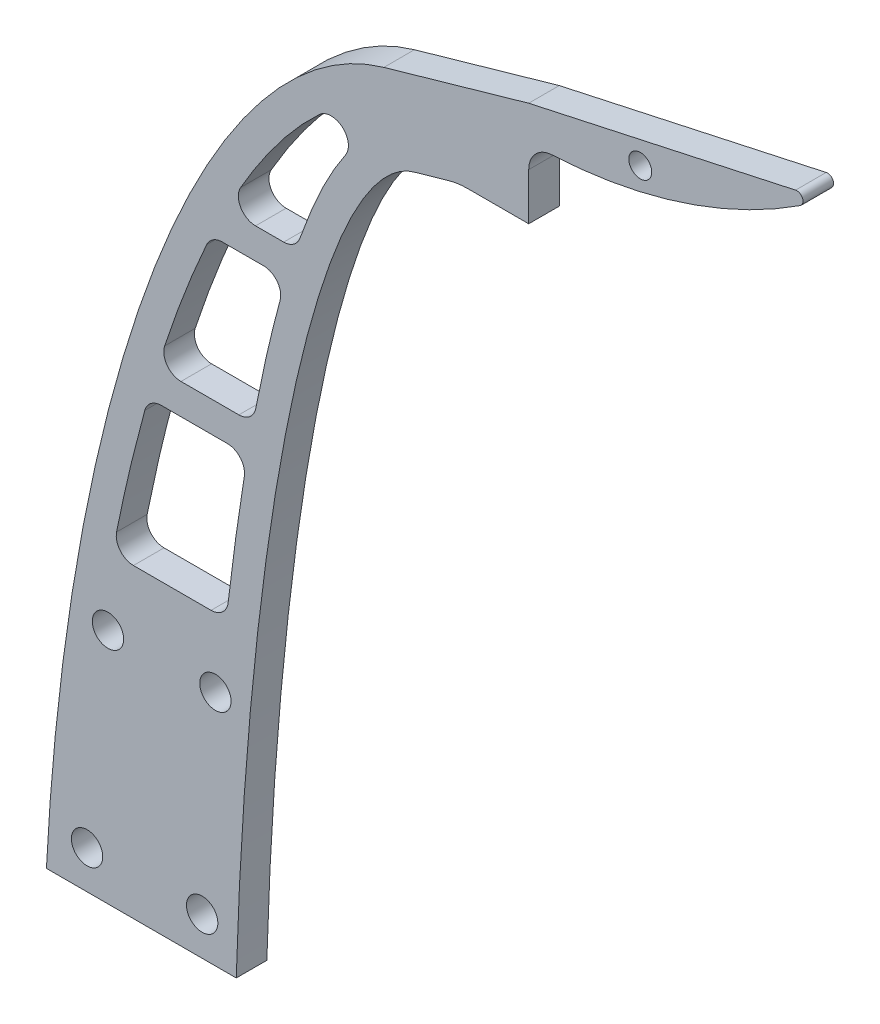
ISO-10303-21;
HEADER;
FILE_DESCRIPTION(('STEP AP214'),'2;1');
FILE_NAME('part.step','',(''),(''),'','','');
FILE_SCHEMA(('AUTOMOTIVE_DESIGN { 1 0 10303 214 1 1 1 1 }'));
ENDSEC;
DATA;
#1=APPLICATION_CONTEXT('core data for automotive mechanical design processes');
#2=APPLICATION_PROTOCOL_DEFINITION('international standard','automotive_design',2000,#1);
#3=PRODUCT_CONTEXT('',#1,'mechanical');
#4=PRODUCT('Part','Part','',(#3));
#5=PRODUCT_RELATED_PRODUCT_CATEGORY('part','',(#4));
#6=PRODUCT_DEFINITION_FORMATION('','',#4);
#7=PRODUCT_DEFINITION_CONTEXT('part definition',#1,'design');
#8=PRODUCT_DEFINITION('design','',#6,#7);
#9=PRODUCT_DEFINITION_SHAPE('','',#8);
#10=(LENGTH_UNIT() NAMED_UNIT(*) SI_UNIT(.MILLI.,.METRE.));
#11=(NAMED_UNIT(*) PLANE_ANGLE_UNIT() SI_UNIT($,.RADIAN.));
#12=(NAMED_UNIT(*) SI_UNIT($,.STERADIAN.) SOLID_ANGLE_UNIT());
#13=UNCERTAINTY_MEASURE_WITH_UNIT(LENGTH_MEASURE(1.E-05),#10,'distance_accuracy_value','');
#14=(GEOMETRIC_REPRESENTATION_CONTEXT(3) GLOBAL_UNCERTAINTY_ASSIGNED_CONTEXT((#13)) GLOBAL_UNIT_ASSIGNED_CONTEXT((#10,
#11,#12)) REPRESENTATION_CONTEXT('',''));
#15=CARTESIAN_POINT('',(0.,0.,0.));
#16=DIRECTION('',(0.,0.,1.));
#17=DIRECTION('',(1.,0.,0.));
#18=AXIS2_PLACEMENT_3D('',#15,#16,#17);
#19=CARTESIAN_POINT('',(-144.803089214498,-104.554103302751,389.315608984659));
#20=DIRECTION('',(0.,1.,0.));
#21=DIRECTION('',(0.,0.,1.));
#22=AXIS2_PLACEMENT_3D('',#19,#20,#21);
#23=PLANE('',#22);
#24=DIRECTION('',(0.,0.,-1.));
#25=VECTOR('',#24,1.);
#26=CARTESIAN_POINT('',(-38.9912311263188,-104.554103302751,4.));
#27=LINE('',#26,#25);
#28=CARTESIAN_POINT('',(-38.9912311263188,-104.554103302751,4.));
#29=VERTEX_POINT('',#28);
#30=CARTESIAN_POINT('',(-38.9912311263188,-104.554103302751,0.));
#31=VERTEX_POINT('',#30);
#32=EDGE_CURVE('E626',#29,#31,#27,.T.);
#33=ORIENTED_EDGE('',*,*,#32,.F.);
#34=DIRECTION('',(-1.,0.,0.));
#35=VECTOR('',#34,1.);
#36=CARTESIAN_POINT('',(-14.239497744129,-104.554103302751,4.));
#37=LINE('',#36,#35);
#38=CARTESIAN_POINT('',(-63.8196316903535,-104.554103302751,4.));
#39=VERTEX_POINT('',#38);
#40=EDGE_CURVE('E632',#29,#39,#37,.T.);
#41=ORIENTED_EDGE('',*,*,#40,.T.);
#42=DIRECTION('',(0.,0.,-1.));
#43=VECTOR('',#42,1.);
#44=CARTESIAN_POINT('',(-63.8196316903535,-104.554103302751,4.));
#45=LINE('',#44,#43);
#46=CARTESIAN_POINT('',(-63.8196316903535,-104.554103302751,0.));
#47=VERTEX_POINT('',#46);
#48=EDGE_CURVE('E629',#47,#39,#45,.F.);
#49=ORIENTED_EDGE('',*,*,#48,.F.);
#50=DIRECTION('',(-1.,0.,0.));
#51=VECTOR('',#50,1.);
#52=CARTESIAN_POINT('',(-14.239497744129,-104.554103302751,0.));
#53=LINE('',#52,#51);
#54=EDGE_CURVE('E11',#31,#47,#53,.T.);
#55=ORIENTED_EDGE('',*,*,#54,.F.);
#56=EDGE_LOOP('',(#33,#41,#49,#55));
#57=FACE_BOUND('',#56,.T.);
#58=ADVANCED_FACE('F32',(#57),#23,.F.);
#59=CARTESIAN_POINT('',(-0.739497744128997,0.,4.));
#60=DIRECTION('',(0.,1.,0.));
#61=DIRECTION('',(-1.,0.,0.));
#62=AXIS2_PLACEMENT_3D('',#59,#60,#61);
#63=PLANE('',#62);
#64=DIRECTION('',(1.,0.,0.));
#65=VECTOR('',#64,1.);
#66=CARTESIAN_POINT('',(-0.739497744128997,0.,0.));
#67=LINE('',#66,#65);
#68=CARTESIAN_POINT('',(-8.739497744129,0.,0.));
#69=VERTEX_POINT('',#68);
#70=CARTESIAN_POINT('',(-0.739497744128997,0.,0.));
#71=VERTEX_POINT('',#70);
#72=EDGE_CURVE('E638',#69,#71,#67,.T.);
#73=ORIENTED_EDGE('',*,*,#72,.T.);
#74=DIRECTION('',(0.,0.,-1.));
#75=VECTOR('',#74,1.);
#76=CARTESIAN_POINT('',(-0.739497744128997,0.,4.));
#77=LINE('',#76,#75);
#78=CARTESIAN_POINT('',(-0.739497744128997,0.,4.));
#79=VERTEX_POINT('',#78);
#80=EDGE_CURVE('E774',#79,#71,#77,.T.);
#81=ORIENTED_EDGE('',*,*,#80,.F.);
#82=DIRECTION('',(1.,0.,0.));
#83=VECTOR('',#82,1.);
#84=CARTESIAN_POINT('',(-0.739497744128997,0.,4.));
#85=LINE('',#84,#83);
#86=CARTESIAN_POINT('',(-8.739497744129,0.,4.));
#87=VERTEX_POINT('',#86);
#88=EDGE_CURVE('E641',#87,#79,#85,.T.);
#89=ORIENTED_EDGE('',*,*,#88,.F.);
#90=DIRECTION('',(0.,0.,-1.));
#91=VECTOR('',#90,1.);
#92=CARTESIAN_POINT('',(-8.739497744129,0.,4.));
#93=LINE('',#92,#91);
#94=EDGE_CURVE('E730',#87,#69,#93,.T.);
#95=ORIENTED_EDGE('',*,*,#94,.T.);
#96=EDGE_LOOP('',(#73,#81,#89,#95));
#97=FACE_BOUND('',#96,.T.);
#98=ADVANCED_FACE('F684',(#97),#63,.F.);
#99=CARTESIAN_POINT('',(-0.739497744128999,9.25999999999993,4.));
#100=DIRECTION('',(-1.,0.,0.));
#101=DIRECTION('',(0.,-1.,0.));
#102=AXIS2_PLACEMENT_3D('',#99,#100,#101);
#103=PLANE('',#102);
#104=DIRECTION('',(0.,1.,0.));
#105=VECTOR('',#104,1.);
#106=CARTESIAN_POINT('',(-0.739497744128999,9.25999999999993,0.));
#107=LINE('',#106,#105);
#108=CARTESIAN_POINT('',(-0.739497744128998,6.13511467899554,0.));
#109=VERTEX_POINT('',#108);
#110=EDGE_CURVE('E745',#71,#109,#107,.T.);
#111=ORIENTED_EDGE('',*,*,#110,.T.);
#112=DIRECTION('',(0.,0.,1.));
#113=VECTOR('',#112,1.);
#114=CARTESIAN_POINT('',(-0.739497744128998,6.13511467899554,4.));
#115=LINE('',#114,#113);
#116=CARTESIAN_POINT('',(-0.739497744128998,6.13511467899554,4.));
#117=VERTEX_POINT('',#116);
#118=EDGE_CURVE('E779',#109,#117,#115,.T.);
#119=ORIENTED_EDGE('',*,*,#118,.T.);
#120=DIRECTION('',(0.,1.,0.));
#121=VECTOR('',#120,1.);
#122=CARTESIAN_POINT('',(-0.739497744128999,9.25999999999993,4.));
#123=LINE('',#122,#121);
#124=EDGE_CURVE('E644',#79,#117,#123,.T.);
#125=ORIENTED_EDGE('',*,*,#124,.F.);
#126=ORIENTED_EDGE('',*,*,#80,.T.);
#127=EDGE_LOOP('',(#111,#119,#125,#126));
#128=FACE_BOUND('',#127,.T.);
#129=ADVANCED_FACE('F680',(#128),#103,.F.);
#130=CARTESIAN_POINT('',(-0.739497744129,74.26,4.));
#131=DIRECTION('',(0.,0.,-1.));
#132=DIRECTION('',(-1.,0.,0.));
#133=AXIS2_PLACEMENT_3D('',#130,#131,#132);
#134=CYLINDRICAL_SURFACE('',#133,65.);
#135=CARTESIAN_POINT('',(-0.739497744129,74.26,0.));
#136=DIRECTION('',(0.,0.,1.));
#137=DIRECTION('',(1.,0.,0.));
#138=AXIS2_PLACEMENT_3D('',#135,#136,#137);
#139=CIRCLE('',#138,65.);
#140=CARTESIAN_POINT('',(2.31035562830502,9.33159023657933,0.));
#141=VERTEX_POINT('',#140);
#142=CARTESIAN_POINT('',(34.773474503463,19.8189419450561,0.));
#143=VERTEX_POINT('',#142);
#144=EDGE_CURVE('E748',#141,#143,#139,.T.);
#145=ORIENTED_EDGE('',*,*,#144,.T.);
#146=DIRECTION('',(0.,0.,-1.));
#147=VECTOR('',#146,1.);
#148=CARTESIAN_POINT('',(34.773474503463,19.8189419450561,4.));
#149=LINE('',#148,#147);
#150=CARTESIAN_POINT('',(34.773474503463,19.8189419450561,4.));
#151=VERTEX_POINT('',#150);
#152=EDGE_CURVE('E790',#143,#151,#149,.F.);
#153=ORIENTED_EDGE('',*,*,#152,.T.);
#154=CARTESIAN_POINT('',(-0.739497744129,74.26,4.));
#155=DIRECTION('',(0.,0.,1.));
#156=DIRECTION('',(1.,0.,0.));
#157=AXIS2_PLACEMENT_3D('',#154,#155,#156);
#158=CIRCLE('',#157,65.);
#159=CARTESIAN_POINT('',(2.31035562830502,9.33159023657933,4.));
#160=VERTEX_POINT('',#159);
#161=EDGE_CURVE('E648',#160,#151,#158,.T.);
#162=ORIENTED_EDGE('',*,*,#161,.F.);
#163=DIRECTION('',(0.,0.,-1.));
#164=VECTOR('',#163,1.);
#165=CARTESIAN_POINT('',(2.31035562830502,9.33159023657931,4.));
#166=LINE('',#165,#164);
#167=EDGE_CURVE('E776',#160,#141,#166,.T.);
#168=ORIENTED_EDGE('',*,*,#167,.T.);
#169=EDGE_LOOP('',(#145,#153,#162,#168));
#170=FACE_BOUND('',#169,.T.);
#171=ADVANCED_FACE('F676',(#170),#134,.T.);
#172=CARTESIAN_POINT('',(-0.739497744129,13.66,4.));
#173=DIRECTION('',(0.213030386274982,-0.977045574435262,0.));
#174=DIRECTION('',(0.977045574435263,0.213030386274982,0.));
#175=AXIS2_PLACEMENT_3D('',#172,#173,#174);
#176=PLANE('',#175);
#177=DIRECTION('',(-0.977045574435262,-0.213030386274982,0.));
#178=VECTOR('',#177,1.);
#179=CARTESIAN_POINT('',(-0.739497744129,13.66,4.));
#180=LINE('',#179,#178);
#181=CARTESIAN_POINT('',(34.165967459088,21.2706221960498,4.));
#182=VERTEX_POINT('',#181);
#183=CARTESIAN_POINT('',(-0.739497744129,13.66,4.));
#184=VERTEX_POINT('',#183);
#185=EDGE_CURVE('E651',#182,#184,#180,.T.);
#186=ORIENTED_EDGE('',*,*,#185,.F.);
#187=DIRECTION('',(0.,0.,-1.));
#188=VECTOR('',#187,1.);
#189=CARTESIAN_POINT('',(34.165967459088,21.2706221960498,4.));
#190=LINE('',#189,#188);
#191=CARTESIAN_POINT('',(34.165967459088,21.2706221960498,0.));
#192=VERTEX_POINT('',#191);
#193=EDGE_CURVE('E785',#182,#192,#190,.T.);
#194=ORIENTED_EDGE('',*,*,#193,.T.);
#195=DIRECTION('',(-0.977045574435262,-0.213030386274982,0.));
#196=VECTOR('',#195,1.);
#197=CARTESIAN_POINT('',(-0.739497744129,13.66,0.));
#198=LINE('',#197,#196);
#199=CARTESIAN_POINT('',(-0.739497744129,13.66,0.));
#200=VERTEX_POINT('',#199);
#201=EDGE_CURVE('E754',#192,#200,#198,.T.);
#202=ORIENTED_EDGE('',*,*,#201,.T.);
#203=DIRECTION('',(0.,0.,-1.));
#204=VECTOR('',#203,1.);
#205=CARTESIAN_POINT('',(-0.739497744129,13.66,4.));
#206=LINE('',#205,#204);
#207=EDGE_CURVE('E771',#184,#200,#206,.T.);
#208=ORIENTED_EDGE('',*,*,#207,.F.);
#209=EDGE_LOOP('',(#186,#194,#202,#208));
#210=FACE_BOUND('',#209,.T.);
#211=ADVANCED_FACE('F672',(#210),#176,.F.);
#212=CARTESIAN_POINT('',(-0.739497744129,13.66,4.));
#213=DIRECTION('',(0.274722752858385,-0.961523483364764,0.));
#214=DIRECTION('',(0.961523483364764,0.274722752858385,0.));
#215=AXIS2_PLACEMENT_3D('',#212,#213,#214);
#216=PLANE('',#215);
#217=DIRECTION('',(-0.961523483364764,-0.274722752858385,0.));
#218=VECTOR('',#217,1.);
#219=CARTESIAN_POINT('',(-0.739497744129,13.66,0.));
#220=LINE('',#219,#218);
#221=CARTESIAN_POINT('',(-19.6826829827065,8.24762673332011,0.));
#222=VERTEX_POINT('',#221);
#223=EDGE_CURVE('E756',#200,#222,#220,.T.);
#224=ORIENTED_EDGE('',*,*,#223,.T.);
#225=DIRECTION('',(0.,0.,-1.));
#226=VECTOR('',#225,1.);
#227=CARTESIAN_POINT('',(-19.6826829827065,8.24762673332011,4.));
#228=LINE('',#227,#226);
#229=CARTESIAN_POINT('',(-19.6826829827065,8.24762673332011,4.));
#230=VERTEX_POINT('',#229);
#231=EDGE_CURVE('E768',#230,#222,#228,.T.);
#232=ORIENTED_EDGE('',*,*,#231,.F.);
#233=DIRECTION('',(-0.961523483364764,-0.274722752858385,0.));
#234=VECTOR('',#233,1.);
#235=CARTESIAN_POINT('',(-0.739497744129,13.66,4.));
#236=LINE('',#235,#234);
#237=EDGE_CURVE('E653',#184,#230,#236,.T.);
#238=ORIENTED_EDGE('',*,*,#237,.F.);
#239=ORIENTED_EDGE('',*,*,#207,.T.);
#240=EDGE_LOOP('',(#224,#232,#238,#239));
#241=FACE_BOUND('',#240,.T.);
#242=ADVANCED_FACE('F668',(#241),#216,.F.);
#243=CARTESIAN_POINT('',(-14.239497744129,-121.423692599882,4.));
#244=DIRECTION('',(0.,0.,1.));
#245=DIRECTION('',(0.,1.,0.));
#246=AXIS2_PLACEMENT_3D('',#243,#244,#245);
#247=ELLIPSE('',#246,130.446604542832,50.);
#248=DIRECTION('',(0.,0.,-1.));
#249=VECTOR('',#248,1.);
#250=SURFACE_OF_LINEAR_EXTRUSION('',#247,#249);
#251=CARTESIAN_POINT('',(-14.239497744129,-121.423692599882,0.));
#252=DIRECTION('',(0.,0.,1.));
#253=DIRECTION('',(0.,1.,0.));
#254=AXIS2_PLACEMENT_3D('',#251,#252,#253);
#255=ELLIPSE('',#254,130.446604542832,50.);
#256=EDGE_CURVE('E758',#222,#47,#255,.T.);
#257=ORIENTED_EDGE('',*,*,#256,.T.);
#258=ORIENTED_EDGE('',*,*,#48,.T.);
#259=EDGE_CURVE('E655',#230,#39,#247,.T.);
#260=ORIENTED_EDGE('',*,*,#259,.F.);
#261=ORIENTED_EDGE('',*,*,#231,.T.);
#262=EDGE_LOOP('',(#257,#258,#260,#261));
#263=FACE_BOUND('',#262,.T.);
#264=ADVANCED_FACE('F663',(#263),#250,.F.);
#265=CARTESIAN_POINT('',(-14.239497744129,-121.423692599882,4.));
#266=DIRECTION('',(0.,0.,-1.));
#267=DIRECTION('',(0.,-1.,0.));
#268=AXIS2_PLACEMENT_3D('',#265,#266,#267);
#269=ELLIPSE('',#268,120.,25.);
#270=DIRECTION('',(0.,0.,-1.));
#271=VECTOR('',#270,1.);
#272=SURFACE_OF_LINEAR_EXTRUSION('',#269,#271);
#273=CARTESIAN_POINT('',(-15.7249732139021,-1.63571709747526,4.));
#274=VERTEX_POINT('',#273);
#275=EDGE_CURVE('E659',#29,#274,#269,.T.);
#276=ORIENTED_EDGE('',*,*,#275,.F.);
#277=ORIENTED_EDGE('',*,*,#32,.T.);
#278=CARTESIAN_POINT('',(-14.239497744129,-121.423692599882,0.));
#279=DIRECTION('',(0.,0.,-1.));
#280=DIRECTION('',(0.,-1.,0.));
#281=AXIS2_PLACEMENT_3D('',#278,#279,#280);
#282=ELLIPSE('',#281,120.,25.);
#283=CARTESIAN_POINT('',(-15.7249732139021,-1.63571709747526,0.));
#284=VERTEX_POINT('',#283);
#285=EDGE_CURVE('E761',#31,#284,#282,.T.);
#286=ORIENTED_EDGE('',*,*,#285,.T.);
#287=DIRECTION('',(0.,0.,-1.));
#288=VECTOR('',#287,1.);
#289=CARTESIAN_POINT('',(-15.7249732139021,-1.63571709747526,4.));
#290=LINE('',#289,#288);
#291=EDGE_CURVE('E765',#274,#284,#290,.T.);
#292=ORIENTED_EDGE('',*,*,#291,.F.);
#293=EDGE_LOOP('',(#276,#277,#286,#292));
#294=FACE_BOUND('',#293,.T.);
#295=ADVANCED_FACE('F667',(#294),#272,.F.);
#296=CARTESIAN_POINT('',(-11.2120025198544,-0.346288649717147,4.));
#297=DIRECTION('',(-0.274722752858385,0.961523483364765,0.));
#298=DIRECTION('',(-0.961523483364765,-0.274722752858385,0.));
#299=AXIS2_PLACEMENT_3D('',#296,#297,#298);
#300=PLANE('',#299);
#301=DIRECTION('',(0.961523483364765,0.274722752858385,0.));
#302=VECTOR('',#301,1.);
#303=CARTESIAN_POINT('',(-11.2120025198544,-0.346288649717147,0.));
#304=LINE('',#303,#302);
#305=CARTESIAN_POINT('',(-11.2120025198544,-0.346288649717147,0.));
#306=VERTEX_POINT('',#305);
#307=EDGE_CURVE('E737',#284,#306,#304,.T.);
#308=ORIENTED_EDGE('',*,*,#307,.T.);
#309=DIRECTION('',(0.,0.,-1.));
#310=VECTOR('',#309,1.);
#311=CARTESIAN_POINT('',(-11.2120025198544,-0.346288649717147,4.));
#312=LINE('',#311,#310);
#313=CARTESIAN_POINT('',(-11.2120025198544,-0.346288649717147,4.));
#314=VERTEX_POINT('',#313);
#315=EDGE_CURVE('E733',#314,#306,#312,.T.);
#316=ORIENTED_EDGE('',*,*,#315,.F.);
#317=DIRECTION('',(0.961523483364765,0.274722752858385,0.));
#318=VECTOR('',#317,1.);
#319=CARTESIAN_POINT('',(-11.2120025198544,-0.346288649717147,4.));
#320=LINE('',#319,#318);
#321=EDGE_CURVE('E1277',#274,#314,#320,.T.);
#322=ORIENTED_EDGE('',*,*,#321,.F.);
#323=ORIENTED_EDGE('',*,*,#291,.T.);
#324=EDGE_LOOP('',(#308,#316,#322,#323));
#325=FACE_BOUND('',#324,.T.);
#326=ADVANCED_FACE('F719',(#325),#300,.F.);
#327=CARTESIAN_POINT('',(-8.739497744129,-9.00000000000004,4.));
#328=DIRECTION('',(0.,0.,-1.));
#329=DIRECTION('',(-1.,0.,0.));
#330=AXIS2_PLACEMENT_3D('',#327,#328,#329);
#331=CYLINDRICAL_SURFACE('',#330,9.);
#332=CARTESIAN_POINT('',(-8.739497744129,-9.00000000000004,0.));
#333=DIRECTION('',(0.,0.,-1.));
#334=DIRECTION('',(1.,0.,0.));
#335=AXIS2_PLACEMENT_3D('',#332,#333,#334);
#336=CIRCLE('',#335,9.);
#337=EDGE_CURVE('E645',#306,#69,#336,.T.);
#338=ORIENTED_EDGE('',*,*,#337,.T.);
#339=ORIENTED_EDGE('',*,*,#94,.F.);
#340=CARTESIAN_POINT('',(-8.739497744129,-9.00000000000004,4.));
#341=DIRECTION('',(0.,0.,-1.));
#342=DIRECTION('',(1.,0.,0.));
#343=AXIS2_PLACEMENT_3D('',#340,#341,#342);
#344=CIRCLE('',#343,9.);
#345=EDGE_CURVE('E741',#314,#87,#344,.T.);
#346=ORIENTED_EDGE('',*,*,#345,.F.);
#347=ORIENTED_EDGE('',*,*,#315,.T.);
#348=EDGE_LOOP('',(#338,#339,#346,#347));
#349=FACE_BOUND('',#348,.T.);
#350=ADVANCED_FACE('F303',(#349),#331,.F.);
#351=CARTESIAN_POINT('',(-14.239497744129,-121.423692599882,4.));
#352=DIRECTION('',(0.,0.,1.));
#353=DIRECTION('',(1.,0.,0.));
#354=AXIS2_PLACEMENT_3D('',#351,#352,#353);
#355=PLANE('',#354);
#356=CARTESIAN_POINT('',(-50.9547051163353,-46.2467814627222,4.));
#357=CARTESIAN_POINT('',(-52.3229488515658,-51.202713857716,4.));
#358=CARTESIAN_POINT('',(-53.5580794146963,-56.4270118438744,4.));
#359=CARTESIAN_POINT('',(-54.6453564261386,-61.8627950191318,4.));
#360=B_SPLINE_CURVE_WITH_KNOTS('',3,(#356,#357,#358,#359),.UNSPECIFIED.,.F.,.F.,(4,4),
(0.628736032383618,0.736306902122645),.UNSPECIFIED.);
#361=CARTESIAN_POINT('',(-50.9547051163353,-46.2467814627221,4.));
#362=VERTEX_POINT('',#361);
#363=CARTESIAN_POINT('',(-54.6453564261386,-61.8627950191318,4.));
#364=VERTEX_POINT('',#363);
#365=EDGE_CURVE('E51',#362,#364,#360,.T.);
#366=ORIENTED_EDGE('',*,*,#365,.F.);
#367=CARTESIAN_POINT('',(-48.7858440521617,-46.8455649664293,4.));
#368=DIRECTION('',(0.,0.,1.));
#369=DIRECTION('',(-1.,0.,0.));
#370=AXIS2_PLACEMENT_3D('',#367,#368,#369);
#371=CIRCLE('',#370,2.25);
#372=CARTESIAN_POINT('',(-48.7858440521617,-44.5955649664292,4.));
#373=VERTEX_POINT('',#372);
#374=EDGE_CURVE('E279',#373,#362,#371,.T.);
#375=ORIENTED_EDGE('',*,*,#374,.F.);
#376=DIRECTION('',(-1.,0.,0.));
#377=VECTOR('',#376,1.);
#378=CARTESIAN_POINT('',(-48.7858440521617,-44.5955649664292,4.));
#379=LINE('',#378,#377);
#380=CARTESIAN_POINT('',(-40.1581210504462,-44.5955649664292,4.));
#381=VERTEX_POINT('',#380);
#382=EDGE_CURVE('E431',#381,#373,#379,.T.);
#383=ORIENTED_EDGE('',*,*,#382,.F.);
#384=CARTESIAN_POINT('',(-40.1581210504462,-46.8455649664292,4.));
#385=DIRECTION('',(0.,0.,1.));
#386=DIRECTION('',(1.,0.,0.));
#387=AXIS2_PLACEMENT_3D('',#384,#385,#386);
#388=CIRCLE('',#387,2.25);
#389=CARTESIAN_POINT('',(-37.9369761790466,-47.2047521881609,4.));
#390=VERTEX_POINT('',#389);
#391=EDGE_CURVE('E434',#390,#381,#388,.T.);
#392=ORIENTED_EDGE('',*,*,#391,.F.);
#393=CARTESIAN_POINT('',(-40.0526204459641,-62.5635092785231,4.));
#394=CARTESIAN_POINT('',(-39.451802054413,-57.3869635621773,4.));
#395=CARTESIAN_POINT('',(-38.7711773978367,-52.4160019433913,4.));
#396=CARTESIAN_POINT('',(-37.9903265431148,-47.5355413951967,4.));
#397=CARTESIAN_POINT('',(-37.9636967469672,-47.3699870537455,4.));
#398=CARTESIAN_POINT('',(-37.9369761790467,-47.2047521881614,4.));
#399=B_SPLINE_CURVE_WITH_KNOTS('',3,(#393,#394,#395,#396,#397,#398),.UNSPECIFIED.,.F.,.F.,(4,2,
4),(0.26798181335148,0.375,0.378765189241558),.UNSPECIFIED.);
#400=CARTESIAN_POINT('',(-40.0526204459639,-62.5635092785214,4.));
#401=VERTEX_POINT('',#400);
#402=EDGE_CURVE('E393',#401,#390,#399,.T.);
#403=ORIENTED_EDGE('',*,*,#402,.F.);
#404=CARTESIAN_POINT('',(-42.2876167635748,-62.3041033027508,4.));
#405=DIRECTION('',(0.,0.,1.));
#406=DIRECTION('',(1.,0.,0.));
#407=AXIS2_PLACEMENT_3D('',#404,#405,#406);
#408=CIRCLE('',#407,2.25000000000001);
#409=CARTESIAN_POINT('',(-42.2876167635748,-64.5541033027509,4.));
#410=VERTEX_POINT('',#409);
#411=EDGE_CURVE('E399',#410,#401,#408,.T.);
#412=ORIENTED_EDGE('',*,*,#411,.F.);
#413=DIRECTION('',(1.,0.,0.));
#414=VECTOR('',#413,1.);
#415=CARTESIAN_POINT('',(-52.4390593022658,-64.5541033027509,4.));
#416=LINE('',#415,#414);
#417=CARTESIAN_POINT('',(-52.4390593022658,-64.5541033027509,4.));
#418=VERTEX_POINT('',#417);
#419=EDGE_CURVE('E427',#418,#410,#416,.T.);
#420=ORIENTED_EDGE('',*,*,#419,.F.);
#421=CARTESIAN_POINT('',(-52.4390593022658,-62.3041033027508,4.));
#422=DIRECTION('',(0.,0.,1.));
#423=DIRECTION('',(1.,0.,0.));
#424=AXIS2_PLACEMENT_3D('',#421,#422,#423);
#425=CIRCLE('',#424,2.25000000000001);
#426=EDGE_CURVE('E430',#364,#418,#425,.T.);
#427=ORIENTED_EDGE('',*,*,#426,.F.);
#428=EDGE_LOOP('',(#366,#375,#383,#392,#403,#412,#420,#427));
#429=FACE_BOUND('',#428,.T.);
#430=CARTESIAN_POINT('',(-46.2198326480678,-38.3455649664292,4.));
#431=DIRECTION('',(0.,0.,1.));
#432=DIRECTION('',(-1.,0.,0.));
#433=AXIS2_PLACEMENT_3D('',#430,#431,#432);
#434=CIRCLE('',#433,2.25);
#435=CARTESIAN_POINT('',(-48.3568206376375,-37.6414468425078,4.));
#436=VERTEX_POINT('',#435);
#437=CARTESIAN_POINT('',(-46.2198326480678,-40.5955649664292,4.));
#438=VERTEX_POINT('',#437);
#439=EDGE_CURVE('E922',#436,#438,#434,.T.);
#440=ORIENTED_EDGE('',*,*,#439,.F.);
#441=CARTESIAN_POINT('',(-42.8576032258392,-23.4156244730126,4.));
#442=CARTESIAN_POINT('',(-43.7662092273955,-25.4174521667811,4.));
#443=CARTESIAN_POINT('',(-44.6494892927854,-27.5129785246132,4.));
#444=CARTESIAN_POINT('',(-46.4952511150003,-32.2302309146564,4.));
#445=CARTESIAN_POINT('',(-47.4477173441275,-34.8823319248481,4.));
#446=CARTESIAN_POINT('',(-48.3568206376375,-37.6414468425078,4.));
#447=B_SPLINE_CURVE_WITH_KNOTS('',3,(#441,#442,#443,#444,#445,#446),.UNSPECIFIED.,.F.,.F.,(4,2,
4),(0.44460194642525,0.5,0.564303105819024),.UNSPECIFIED.);
#448=CARTESIAN_POINT('',(-42.8576032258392,-23.4156244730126,4.));
#449=VERTEX_POINT('',#448);
#450=EDGE_CURVE('E354',#449,#436,#447,.T.);
#451=ORIENTED_EDGE('',*,*,#450,.F.);
#452=CARTESIAN_POINT('',(-40.8087716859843,-24.3455649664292,4.));
#453=DIRECTION('',(0.,0.,1.));
#454=DIRECTION('',(-1.,0.,0.));
#455=AXIS2_PLACEMENT_3D('',#452,#453,#454);
#456=CIRCLE('',#455,2.25);
#457=CARTESIAN_POINT('',(-40.8087716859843,-22.0955649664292,4.));
#458=VERTEX_POINT('',#457);
#459=EDGE_CURVE('E967',#458,#449,#456,.T.);
#460=ORIENTED_EDGE('',*,*,#459,.F.);
#461=DIRECTION('',(-1.,0.,0.));
#462=VECTOR('',#461,1.);
#463=CARTESIAN_POINT('',(-40.8087716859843,-22.0955649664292,4.));
#464=LINE('',#463,#462);
#465=CARTESIAN_POINT('',(-35.4253640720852,-22.0955649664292,4.));
#466=VERTEX_POINT('',#465);
#467=EDGE_CURVE('E555',#466,#458,#464,.T.);
#468=ORIENTED_EDGE('',*,*,#467,.F.);
#469=CARTESIAN_POINT('',(-35.4253640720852,-24.3455649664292,4.));
#470=DIRECTION('',(0.,0.,1.));
#471=DIRECTION('',(1.,0.,0.));
#472=AXIS2_PLACEMENT_3D('',#469,#470,#471);
#473=CIRCLE('',#472,2.25);
#474=CARTESIAN_POINT('',(-33.2549471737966,-24.9386842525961,4.));
#475=VERTEX_POINT('',#474);
#476=EDGE_CURVE('E552',#475,#466,#473,.T.);
#477=ORIENTED_EDGE('',*,*,#476,.F.);
#478=CARTESIAN_POINT('',(-36.4409572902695,-38.77508251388,4.));
#479=CARTESIAN_POINT('',(-36.0062299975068,-36.5396706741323,4.));
#480=CARTESIAN_POINT('',(-35.553290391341,-34.3789903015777,4.));
#481=CARTESIAN_POINT('',(-34.4998254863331,-29.7189840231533,4.));
#482=CARTESIAN_POINT('',(-33.8901442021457,-27.2630773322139,4.));
#483=CARTESIAN_POINT('',(-33.2549471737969,-24.9386842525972,4.));
#484=B_SPLINE_CURVE_WITH_KNOTS('',3,(#478,#479,#480,#481,#482,#483),.UNSPECIFIED.,.F.,.F.,(4,2,
4),(0.445132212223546,0.5,0.56804236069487),.UNSPECIFIED.);
#485=CARTESIAN_POINT('',(-36.4409572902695,-38.77508251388,4.));
#486=VERTEX_POINT('',#485);
#487=EDGE_CURVE('E340',#486,#475,#484,.T.);
#488=ORIENTED_EDGE('',*,*,#487,.F.);
#489=CARTESIAN_POINT('',(-38.6495800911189,-38.3455649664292,4.));
#490=DIRECTION('',(0.,0.,1.));
#491=DIRECTION('',(1.,0.,0.));
#492=AXIS2_PLACEMENT_3D('',#489,#490,#491);
#493=CIRCLE('',#492,2.25);
#494=CARTESIAN_POINT('',(-38.6495800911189,-40.5955649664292,4.));
#495=VERTEX_POINT('',#494);
#496=EDGE_CURVE('E541',#495,#486,#493,.T.);
#497=ORIENTED_EDGE('',*,*,#496,.F.);
#498=DIRECTION('',(1.,0.,0.));
#499=VECTOR('',#498,1.);
#500=CARTESIAN_POINT('',(-46.2198326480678,-40.5955649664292,4.));
#501=LINE('',#500,#499);
#502=EDGE_CURVE('E549',#438,#495,#501,.T.);
#503=ORIENTED_EDGE('',*,*,#502,.F.);
#504=EDGE_LOOP('',(#440,#451,#460,#468,#477,#488,#497,#503));
#505=FACE_BOUND('',#504,.T.);
#506=CARTESIAN_POINT('',(-32.7855952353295,-15.8455649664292,4.));
#507=DIRECTION('',(0.,0.,1.));
#508=DIRECTION('',(1.,0.,0.));
#509=AXIS2_PLACEMENT_3D('',#506,#507,#508);
#510=CIRCLE('',#509,2.25);
#511=CARTESIAN_POINT('',(-32.7855952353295,-18.0955649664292,4.));
#512=VERTEX_POINT('',#511);
#513=CARTESIAN_POINT('',(-30.6650915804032,-16.5978709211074,4.));
#514=VERTEX_POINT('',#513);
#515=EDGE_CURVE('E594',#512,#514,#510,.T.);
#516=ORIENTED_EDGE('',*,*,#515,.F.);
#517=DIRECTION('',(1.,0.,0.));
#518=VECTOR('',#517,1.);
#519=CARTESIAN_POINT('',(-32.7855952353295,-18.0955649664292,4.));
#520=LINE('',#519,#518);
#521=CARTESIAN_POINT('',(-36.4666316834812,-18.0955649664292,4.));
#522=VERTEX_POINT('',#521);
#523=EDGE_CURVE('E812',#522,#512,#520,.T.);
#524=ORIENTED_EDGE('',*,*,#523,.F.);
#525=CARTESIAN_POINT('',(-36.4666316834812,-15.8455649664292,4.));
#526=DIRECTION('',(0.,0.,1.));
#527=DIRECTION('',(-1.,0.,0.));
#528=AXIS2_PLACEMENT_3D('',#525,#526,#527);
#529=CIRCLE('',#528,2.25);
#530=CARTESIAN_POINT('',(-38.4146647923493,-14.7196577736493,4.));
#531=VERTEX_POINT('',#530);
#532=EDGE_CURVE('E815',#531,#522,#529,.T.);
#533=ORIENTED_EDGE('',*,*,#532,.F.);
#534=CARTESIAN_POINT('',(-28.0942928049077,-1.28596265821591,4.));
#535=CARTESIAN_POINT('',(-28.3965692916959,-1.56268164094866,4.));
#536=CARTESIAN_POINT('',(-28.6989015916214,-1.84890315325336,4.));
#537=CARTESIAN_POINT('',(-30.1796722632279,-3.29790137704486,4.));
#538=CARTESIAN_POINT('',(-31.3565022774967,-4.59582942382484,4.));
#539=CARTESIAN_POINT('',(-34.5331215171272,-8.51862054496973,4.));
#540=CARTESIAN_POINT('',(-36.5100716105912,-11.4243501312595,4.));
#541=CARTESIAN_POINT('',(-38.4146647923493,-14.7196577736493,4.));
#542=B_SPLINE_CURVE_WITH_KNOTS('',3,(#534,#535,#536,#537,#538,#539,#540,#541),.UNSPECIFIED.,.F.,
.F.,(4,2,2,4),(0.171472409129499,0.1875,0.25,0.357804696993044),.UNSPECIFIED.);
#543=CARTESIAN_POINT('',(-28.0942928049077,-1.28596265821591,4.));
#544=VERTEX_POINT('',#543);
#545=EDGE_CURVE('E872',#544,#531,#542,.T.);
#546=ORIENTED_EDGE('',*,*,#545,.F.);
#547=CARTESIAN_POINT('',(-26.5750100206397,-2.94556496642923,4.));
#548=DIRECTION('',(0.,0.,1.));
#549=DIRECTION('',(1.,0.,0.));
#550=AXIS2_PLACEMENT_3D('',#547,#548,#549);
#551=CIRCLE('',#550,2.25);
#552=CARTESIAN_POINT('',(-24.7253890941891,-4.22673725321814,4.));
#553=VERTEX_POINT('',#552);
#554=EDGE_CURVE('E865',#553,#544,#551,.T.);
#555=ORIENTED_EDGE('',*,*,#554,.F.);
#556=CARTESIAN_POINT('',(-30.6650915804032,-16.5978709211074,4.));
#557=CARTESIAN_POINT('',(-29.6987074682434,-13.8739511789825,4.));
#558=CARTESIAN_POINT('',(-28.684062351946,-11.4160148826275,4.));
#559=CARTESIAN_POINT('',(-26.901692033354,-7.77839166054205,4.));
#560=CARTESIAN_POINT('',(-26.1646384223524,-6.44563666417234,4.));
#561=CARTESIAN_POINT('',(-25.1730695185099,-4.88745430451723,4.));
#562=CARTESIAN_POINT('',(-24.9508832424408,-4.55228183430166,4.));
#563=CARTESIAN_POINT('',(-24.7253890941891,-4.22673725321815,4.));
#564=B_SPLINE_CURVE_WITH_KNOTS('',3,(#556,#557,#558,#559,#560,#561,#562,#563),.UNSPECIFIED.,.F.,
.F.,(4,2,2,4),(0.656025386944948,0.75,0.8125,0.830257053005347),.UNSPECIFIED.);
#565=EDGE_CURVE('E601',#514,#553,#564,.T.);
#566=ORIENTED_EDGE('',*,*,#565,.F.);
#567=EDGE_LOOP('',(#516,#524,#533,#546,#555,#566));
#568=FACE_BOUND('',#567,.T.);
#569=CARTESIAN_POINT('',(-41.7189587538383,-73.5541033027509,4.));
#570=DIRECTION('',(0.,0.,1.));
#571=DIRECTION('',(1.,0.,0.));
#572=AXIS2_PLACEMENT_3D('',#569,#570,#571);
#573=CIRCLE('',#572,2.04999999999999);
#574=CARTESIAN_POINT('',(-39.6689587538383,-73.5541033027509,4.));
#575=VERTEX_POINT('',#574);
#576=EDGE_CURVE('E605',#575,#575,#573,.T.);
#577=ORIENTED_EDGE('',*,*,#576,.F.);
#578=EDGE_LOOP('',(#577));
#579=FACE_BOUND('',#578,.T.);
#580=CARTESIAN_POINT('',(-55.7704318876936,-73.5541033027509,4.));
#581=DIRECTION('',(0.,0.,1.));
#582=DIRECTION('',(1.,0.,0.));
#583=AXIS2_PLACEMENT_3D('',#580,#581,#582);
#584=CIRCLE('',#583,2.04999999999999);
#585=CARTESIAN_POINT('',(-53.7204318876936,-73.5541033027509,4.));
#586=VERTEX_POINT('',#585);
#587=EDGE_CURVE('E612',#586,#586,#584,.T.);
#588=ORIENTED_EDGE('',*,*,#587,.F.);
#589=EDGE_LOOP('',(#588));
#590=FACE_BOUND('',#589,.T.);
#591=CARTESIAN_POINT('',(-58.5038553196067,-99.5541033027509,4.));
#592=DIRECTION('',(0.,0.,1.));
#593=DIRECTION('',(1.,0.,0.));
#594=AXIS2_PLACEMENT_3D('',#591,#592,#593);
#595=CIRCLE('',#594,2.04999999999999);
#596=CARTESIAN_POINT('',(-56.4538553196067,-99.5541033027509,4.));
#597=VERTEX_POINT('',#596);
#598=EDGE_CURVE('E618',#597,#597,#595,.T.);
#599=ORIENTED_EDGE('',*,*,#598,.F.);
#600=EDGE_LOOP('',(#599));
#601=FACE_BOUND('',#600,.T.);
#602=CARTESIAN_POINT('',(-43.4487055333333,-99.5541033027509,4.));
#603=DIRECTION('',(0.,0.,1.));
#604=DIRECTION('',(1.,0.,0.));
#605=AXIS2_PLACEMENT_3D('',#602,#603,#604);
#606=CIRCLE('',#605,2.04999999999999);
#607=CARTESIAN_POINT('',(-41.3987055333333,-99.5541033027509,4.));
#608=VERTEX_POINT('',#607);
#609=EDGE_CURVE('E622',#608,#608,#606,.T.);
#610=ORIENTED_EDGE('',*,*,#609,.F.);
#611=EDGE_LOOP('',(#610));
#612=FACE_BOUND('',#611,.T.);
#613=ORIENTED_EDGE('',*,*,#40,.F.);
#614=ORIENTED_EDGE('',*,*,#275,.T.);
#615=ORIENTED_EDGE('',*,*,#321,.T.);
#616=ORIENTED_EDGE('',*,*,#345,.T.);
#617=ORIENTED_EDGE('',*,*,#88,.T.);
#618=ORIENTED_EDGE('',*,*,#124,.T.);
#619=CARTESIAN_POINT('',(2.460502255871,6.13511467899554,4.));
#620=DIRECTION('',(0.,0.,1.));
#621=DIRECTION('',(1.,0.,0.));
#622=AXIS2_PLACEMENT_3D('',#619,#620,#621);
#623=CIRCLE('',#622,3.2);
#624=EDGE_CURVE('E783',#117,#160,#623,.F.);
#625=ORIENTED_EDGE('',*,*,#624,.T.);
#626=ORIENTED_EDGE('',*,*,#161,.T.);
#627=CARTESIAN_POINT('',(34.336391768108,20.4889857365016,4.));
#628=DIRECTION('',(0.,0.,1.));
#629=DIRECTION('',(1.,0.,0.));
#630=AXIS2_PLACEMENT_3D('',#627,#628,#629);
#631=CIRCLE('',#630,0.8);
#632=EDGE_CURVE('E43',#151,#182,#631,.T.);
#633=ORIENTED_EDGE('',*,*,#632,.T.);
#634=ORIENTED_EDGE('',*,*,#185,.T.);
#635=ORIENTED_EDGE('',*,*,#237,.T.);
#636=ORIENTED_EDGE('',*,*,#259,.T.);
#637=EDGE_LOOP('',(#613,#614,#615,#616,#617,#618,#625,#626,#633,#634,#635,#636));
#638=FACE_BOUND('',#637,.T.);
#639=CARTESIAN_POINT('',(13.8526418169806,13.8887586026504,4.));
#640=DIRECTION('',(0.,0.,1.));
#641=DIRECTION('',(1.,0.,0.));
#642=AXIS2_PLACEMENT_3D('',#639,#640,#641);
#643=CIRCLE('',#642,1.5);
#644=CARTESIAN_POINT('',(15.3526418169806,13.8887586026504,4.));
#645=VERTEX_POINT('',#644);
#646=EDGE_CURVE('E634',#645,#645,#643,.T.);
#647=ORIENTED_EDGE('',*,*,#646,.F.);
#648=EDGE_LOOP('',(#647));
#649=FACE_BOUND('',#648,.T.);
#650=ADVANCED_FACE('F300',(#429,#505,#568,#579,#590,#601,#612,#638,#649),#355,.T.);
#651=CARTESIAN_POINT('',(-14.239497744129,-121.423692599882,0.));
#652=DIRECTION('',(0.,0.,1.));
#653=DIRECTION('',(1.,0.,0.));
#654=AXIS2_PLACEMENT_3D('',#651,#652,#653);
#655=PLANE('',#654);
#656=CARTESIAN_POINT('',(-48.7858440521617,-46.8455649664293,0.));
#657=DIRECTION('',(0.,0.,1.));
#658=DIRECTION('',(-1.,0.,0.));
#659=AXIS2_PLACEMENT_3D('',#656,#657,#658);
#660=CIRCLE('',#659,2.25);
#661=CARTESIAN_POINT('',(-48.7858440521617,-44.5955649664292,0.));
#662=VERTEX_POINT('',#661);
#663=CARTESIAN_POINT('',(-50.9547051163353,-46.2467814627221,0.));
#664=VERTEX_POINT('',#663);
#665=EDGE_CURVE('E267',#662,#664,#660,.T.);
#666=ORIENTED_EDGE('',*,*,#665,.T.);
#667=CARTESIAN_POINT('',(-54.6453564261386,-61.8627950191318,0.));
#668=CARTESIAN_POINT('',(-53.5580794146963,-56.4270118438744,0.));
#669=CARTESIAN_POINT('',(-52.3229488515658,-51.202713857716,0.));
#670=CARTESIAN_POINT('',(-50.9547051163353,-46.2467814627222,0.));
#671=B_SPLINE_CURVE_WITH_KNOTS('',3,(#667,#668,#669,#670),.UNSPECIFIED.,.F.,.F.,(4,4),
(0.628736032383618,0.736306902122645),.UNSPECIFIED.);
#672=CARTESIAN_POINT('',(-54.6453564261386,-61.8627950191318,0.));
#673=VERTEX_POINT('',#672);
#674=EDGE_CURVE('E260',#664,#673,#671,.F.);
#675=ORIENTED_EDGE('',*,*,#674,.T.);
#676=CARTESIAN_POINT('',(-52.4390593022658,-62.3041033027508,0.));
#677=DIRECTION('',(0.,0.,1.));
#678=DIRECTION('',(1.,0.,0.));
#679=AXIS2_PLACEMENT_3D('',#676,#677,#678);
#680=CIRCLE('',#679,2.25000000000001);
#681=CARTESIAN_POINT('',(-52.4390593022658,-64.5541033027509,0.));
#682=VERTEX_POINT('',#681);
#683=EDGE_CURVE('E270',#673,#682,#680,.T.);
#684=ORIENTED_EDGE('',*,*,#683,.T.);
#685=DIRECTION('',(1.,0.,0.));
#686=VECTOR('',#685,1.);
#687=CARTESIAN_POINT('',(-52.4390593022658,-64.5541033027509,0.));
#688=LINE('',#687,#686);
#689=CARTESIAN_POINT('',(-42.2876167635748,-64.5541033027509,0.));
#690=VERTEX_POINT('',#689);
#691=EDGE_CURVE('E60',#682,#690,#688,.T.);
#692=ORIENTED_EDGE('',*,*,#691,.T.);
#693=CARTESIAN_POINT('',(-42.2876167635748,-62.3041033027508,0.));
#694=DIRECTION('',(0.,0.,1.));
#695=DIRECTION('',(1.,0.,0.));
#696=AXIS2_PLACEMENT_3D('',#693,#694,#695);
#697=CIRCLE('',#696,2.25000000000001);
#698=CARTESIAN_POINT('',(-40.0526204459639,-62.5635092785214,0.));
#699=VERTEX_POINT('',#698);
#700=EDGE_CURVE('E370',#690,#699,#697,.T.);
#701=ORIENTED_EDGE('',*,*,#700,.T.);
#702=CARTESIAN_POINT('',(-37.9369761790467,-47.2047521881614,0.));
#703=CARTESIAN_POINT('',(-37.9636967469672,-47.3699870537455,0.));
#704=CARTESIAN_POINT('',(-37.9903265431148,-47.5355413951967,0.));
#705=CARTESIAN_POINT('',(-38.7711773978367,-52.4160019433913,0.));
#706=CARTESIAN_POINT('',(-39.451802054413,-57.3869635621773,0.));
#707=CARTESIAN_POINT('',(-40.0526204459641,-62.5635092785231,0.));
#708=B_SPLINE_CURVE_WITH_KNOTS('',3,(#702,#703,#704,#705,#706,#707),.UNSPECIFIED.,.F.,.F.,(4,2,
4),(0.26798181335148,0.271747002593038,0.378765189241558),.UNSPECIFIED.);
#709=CARTESIAN_POINT('',(-37.9369761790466,-47.2047521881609,0.));
#710=VERTEX_POINT('',#709);
#711=EDGE_CURVE('E366',#699,#710,#708,.F.);
#712=ORIENTED_EDGE('',*,*,#711,.T.);
#713=CARTESIAN_POINT('',(-40.1581210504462,-46.8455649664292,0.));
#714=DIRECTION('',(0.,0.,1.));
#715=DIRECTION('',(1.,0.,0.));
#716=AXIS2_PLACEMENT_3D('',#713,#714,#715);
#717=CIRCLE('',#716,2.25);
#718=CARTESIAN_POINT('',(-40.1581210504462,-44.5955649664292,0.));
#719=VERTEX_POINT('',#718);
#720=EDGE_CURVE('E368',#710,#719,#717,.T.);
#721=ORIENTED_EDGE('',*,*,#720,.T.);
#722=DIRECTION('',(-1.,0.,0.));
#723=VECTOR('',#722,1.);
#724=CARTESIAN_POINT('',(-48.7858440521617,-44.5955649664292,0.));
#725=LINE('',#724,#723);
#726=EDGE_CURVE('E373',#719,#662,#725,.T.);
#727=ORIENTED_EDGE('',*,*,#726,.T.);
#728=EDGE_LOOP('',(#666,#675,#684,#692,#701,#712,#721,#727));
#729=FACE_BOUND('',#728,.T.);
#730=CARTESIAN_POINT('',(-48.3568206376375,-37.6414468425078,0.));
#731=CARTESIAN_POINT('',(-47.4477173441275,-34.8823319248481,0.));
#732=CARTESIAN_POINT('',(-46.4952511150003,-32.2302309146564,0.));
#733=CARTESIAN_POINT('',(-44.6494892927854,-27.5129785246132,0.));
#734=CARTESIAN_POINT('',(-43.7662092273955,-25.4174521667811,0.));
#735=CARTESIAN_POINT('',(-42.8576032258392,-23.4156244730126,0.));
#736=B_SPLINE_CURVE_WITH_KNOTS('',3,(#730,#731,#732,#733,#734,#735),.UNSPECIFIED.,.F.,.F.,(4,2,
4),(0.44460194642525,0.508905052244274,0.564303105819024),.UNSPECIFIED.);
#737=CARTESIAN_POINT('',(-42.8576032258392,-23.4156244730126,0.));
#738=VERTEX_POINT('',#737);
#739=CARTESIAN_POINT('',(-48.3568206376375,-37.6414468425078,0.));
#740=VERTEX_POINT('',#739);
#741=EDGE_CURVE('E929',#738,#740,#736,.F.);
#742=ORIENTED_EDGE('',*,*,#741,.T.);
#743=CARTESIAN_POINT('',(-46.2198326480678,-38.3455649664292,0.));
#744=DIRECTION('',(0.,0.,1.));
#745=DIRECTION('',(-1.,0.,0.));
#746=AXIS2_PLACEMENT_3D('',#743,#744,#745);
#747=CIRCLE('',#746,2.25);
#748=CARTESIAN_POINT('',(-46.2198326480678,-40.5955649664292,0.));
#749=VERTEX_POINT('',#748);
#750=EDGE_CURVE('E509',#740,#749,#747,.T.);
#751=ORIENTED_EDGE('',*,*,#750,.T.);
#752=DIRECTION('',(1.,0.,0.));
#753=VECTOR('',#752,1.);
#754=CARTESIAN_POINT('',(-46.2198326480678,-40.5955649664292,0.));
#755=LINE('',#754,#753);
#756=CARTESIAN_POINT('',(-38.6495800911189,-40.5955649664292,0.));
#757=VERTEX_POINT('',#756);
#758=EDGE_CURVE('E505',#749,#757,#755,.T.);
#759=ORIENTED_EDGE('',*,*,#758,.T.);
#760=CARTESIAN_POINT('',(-38.6495800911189,-38.3455649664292,0.));
#761=DIRECTION('',(0.,0.,1.));
#762=DIRECTION('',(1.,0.,0.));
#763=AXIS2_PLACEMENT_3D('',#760,#761,#762);
#764=CIRCLE('',#763,2.25);
#765=CARTESIAN_POINT('',(-36.4409572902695,-38.77508251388,0.));
#766=VERTEX_POINT('',#765);
#767=EDGE_CURVE('E508',#757,#766,#764,.T.);
#768=ORIENTED_EDGE('',*,*,#767,.T.);
#769=CARTESIAN_POINT('',(-33.2549471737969,-24.9386842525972,0.));
#770=CARTESIAN_POINT('',(-33.8901442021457,-27.2630773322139,0.));
#771=CARTESIAN_POINT('',(-34.4998254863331,-29.7189840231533,0.));
#772=CARTESIAN_POINT('',(-35.553290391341,-34.3789903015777,0.));
#773=CARTESIAN_POINT('',(-36.0062299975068,-36.5396706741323,0.));
#774=CARTESIAN_POINT('',(-36.4409572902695,-38.77508251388,0.));
#775=B_SPLINE_CURVE_WITH_KNOTS('',3,(#769,#770,#771,#772,#773,#774),.UNSPECIFIED.,.F.,.F.,(4,2,
4),(0.445132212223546,0.513174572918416,0.56804236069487),.UNSPECIFIED.);
#776=CARTESIAN_POINT('',(-33.2549471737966,-24.9386842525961,0.));
#777=VERTEX_POINT('',#776);
#778=EDGE_CURVE('E980',#766,#777,#775,.F.);
#779=ORIENTED_EDGE('',*,*,#778,.T.);
#780=CARTESIAN_POINT('',(-35.4253640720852,-24.3455649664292,0.));
#781=DIRECTION('',(0.,0.,1.));
#782=DIRECTION('',(1.,0.,0.));
#783=AXIS2_PLACEMENT_3D('',#780,#781,#782);
#784=CIRCLE('',#783,2.25);
#785=CARTESIAN_POINT('',(-35.4253640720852,-22.0955649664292,0.));
#786=VERTEX_POINT('',#785);
#787=EDGE_CURVE('E983',#777,#786,#784,.T.);
#788=ORIENTED_EDGE('',*,*,#787,.T.);
#789=DIRECTION('',(-1.,0.,0.));
#790=VECTOR('',#789,1.);
#791=CARTESIAN_POINT('',(-40.8087716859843,-22.0955649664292,0.));
#792=LINE('',#791,#790);
#793=CARTESIAN_POINT('',(-40.8087716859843,-22.0955649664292,0.));
#794=VERTEX_POINT('',#793);
#795=EDGE_CURVE('E514',#786,#794,#792,.T.);
#796=ORIENTED_EDGE('',*,*,#795,.T.);
#797=CARTESIAN_POINT('',(-40.8087716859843,-24.3455649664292,0.));
#798=DIRECTION('',(0.,0.,1.));
#799=DIRECTION('',(-1.,0.,0.));
#800=AXIS2_PLACEMENT_3D('',#797,#798,#799);
#801=CIRCLE('',#800,2.25);
#802=EDGE_CURVE('E952',#794,#738,#801,.T.);
#803=ORIENTED_EDGE('',*,*,#802,.T.);
#804=EDGE_LOOP('',(#742,#751,#759,#768,#779,#788,#796,#803));
#805=FACE_BOUND('',#804,.T.);
#806=DIRECTION('',(1.,0.,0.));
#807=VECTOR('',#806,1.);
#808=CARTESIAN_POINT('',(-32.7855952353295,-18.0955649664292,0.));
#809=LINE('',#808,#807);
#810=CARTESIAN_POINT('',(-36.4666316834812,-18.0955649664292,0.));
#811=VERTEX_POINT('',#810);
#812=CARTESIAN_POINT('',(-32.7855952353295,-18.0955649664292,0.));
#813=VERTEX_POINT('',#812);
#814=EDGE_CURVE('E830',#811,#813,#809,.T.);
#815=ORIENTED_EDGE('',*,*,#814,.T.);
#816=CARTESIAN_POINT('',(-32.7855952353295,-15.8455649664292,0.));
#817=DIRECTION('',(0.,0.,1.));
#818=DIRECTION('',(1.,0.,0.));
#819=AXIS2_PLACEMENT_3D('',#816,#817,#818);
#820=CIRCLE('',#819,2.25);
#821=CARTESIAN_POINT('',(-30.6650915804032,-16.5978709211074,0.));
#822=VERTEX_POINT('',#821);
#823=EDGE_CURVE('E807',#813,#822,#820,.T.);
#824=ORIENTED_EDGE('',*,*,#823,.T.);
#825=CARTESIAN_POINT('',(-24.7253890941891,-4.22673725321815,0.));
#826=CARTESIAN_POINT('',(-24.9508832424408,-4.55228183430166,0.));
#827=CARTESIAN_POINT('',(-25.1730695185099,-4.88745430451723,0.));
#828=CARTESIAN_POINT('',(-26.1646384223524,-6.44563666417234,0.));
#829=CARTESIAN_POINT('',(-26.901692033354,-7.77839166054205,0.));
#830=CARTESIAN_POINT('',(-28.684062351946,-11.4160148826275,0.));
#831=CARTESIAN_POINT('',(-29.6987074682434,-13.8739511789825,0.));
#832=CARTESIAN_POINT('',(-30.6650915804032,-16.5978709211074,0.));
#833=B_SPLINE_CURVE_WITH_KNOTS('',3,(#825,#826,#827,#828,#829,#830,#831,#832),.UNSPECIFIED.,.F.,
.F.,(4,2,2,4),(0.656025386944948,0.673782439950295,0.736282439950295,0.830257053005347),.UNSPECIFIED.);
#834=CARTESIAN_POINT('',(-24.7253890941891,-4.22673725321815,0.));
#835=VERTEX_POINT('',#834);
#836=EDGE_CURVE('E801',#822,#835,#833,.F.);
#837=ORIENTED_EDGE('',*,*,#836,.T.);
#838=CARTESIAN_POINT('',(-26.5750100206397,-2.94556496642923,0.));
#839=DIRECTION('',(0.,0.,1.));
#840=DIRECTION('',(1.,0.,0.));
#841=AXIS2_PLACEMENT_3D('',#838,#839,#840);
#842=CIRCLE('',#841,2.25);
#843=CARTESIAN_POINT('',(-28.0942928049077,-1.28596265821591,0.));
#844=VERTEX_POINT('',#843);
#845=EDGE_CURVE('E805',#835,#844,#842,.T.);
#846=ORIENTED_EDGE('',*,*,#845,.T.);
#847=CARTESIAN_POINT('',(-38.4146647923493,-14.7196577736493,0.));
#848=CARTESIAN_POINT('',(-36.5100716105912,-11.4243501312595,0.));
#849=CARTESIAN_POINT('',(-34.5331215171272,-8.51862054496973,0.));
#850=CARTESIAN_POINT('',(-31.3565022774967,-4.59582942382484,0.));
#851=CARTESIAN_POINT('',(-30.1796722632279,-3.29790137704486,0.));
#852=CARTESIAN_POINT('',(-28.6989015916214,-1.84890315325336,0.));
#853=CARTESIAN_POINT('',(-28.3965692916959,-1.56268164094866,0.));
#854=CARTESIAN_POINT('',(-28.0942928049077,-1.28596265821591,0.));
#855=B_SPLINE_CURVE_WITH_KNOTS('',3,(#847,#848,#849,#850,#851,#852,#853,#854),.UNSPECIFIED.,.F.,
.F.,(4,2,2,4),(0.171472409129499,0.279277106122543,0.341777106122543,0.357804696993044),.UNSPECIFIED.);
#856=CARTESIAN_POINT('',(-38.4146647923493,-14.7196577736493,0.));
#857=VERTEX_POINT('',#856);
#858=EDGE_CURVE('E810',#844,#857,#855,.F.);
#859=ORIENTED_EDGE('',*,*,#858,.T.);
#860=CARTESIAN_POINT('',(-36.4666316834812,-15.8455649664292,0.));
#861=DIRECTION('',(0.,0.,1.));
#862=DIRECTION('',(-1.,0.,0.));
#863=AXIS2_PLACEMENT_3D('',#860,#861,#862);
#864=CIRCLE('',#863,2.25);
#865=EDGE_CURVE('E832',#857,#811,#864,.T.);
#866=ORIENTED_EDGE('',*,*,#865,.T.);
#867=EDGE_LOOP('',(#815,#824,#837,#846,#859,#866));
#868=FACE_BOUND('',#867,.T.);
#869=CARTESIAN_POINT('',(-41.7189587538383,-73.5541033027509,0.));
#870=DIRECTION('',(0.,0.,1.));
#871=DIRECTION('',(1.,0.,0.));
#872=AXIS2_PLACEMENT_3D('',#869,#870,#871);
#873=CIRCLE('',#872,2.04999999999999);
#874=CARTESIAN_POINT('',(-39.6689587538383,-73.5541033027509,0.));
#875=VERTEX_POINT('',#874);
#876=EDGE_CURVE('E608',#875,#875,#873,.T.);
#877=ORIENTED_EDGE('',*,*,#876,.T.);
#878=EDGE_LOOP('',(#877));
#879=FACE_BOUND('',#878,.T.);
#880=CARTESIAN_POINT('',(-55.7704318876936,-73.5541033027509,0.));
#881=DIRECTION('',(0.,0.,1.));
#882=DIRECTION('',(1.,0.,0.));
#883=AXIS2_PLACEMENT_3D('',#880,#881,#882);
#884=CIRCLE('',#883,2.04999999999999);
#885=CARTESIAN_POINT('',(-53.7204318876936,-73.5541033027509,0.));
#886=VERTEX_POINT('',#885);
#887=EDGE_CURVE('E615',#886,#886,#884,.T.);
#888=ORIENTED_EDGE('',*,*,#887,.T.);
#889=EDGE_LOOP('',(#888));
#890=FACE_BOUND('',#889,.T.);
#891=CARTESIAN_POINT('',(-58.5038553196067,-99.5541033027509,0.));
#892=DIRECTION('',(0.,0.,1.));
#893=DIRECTION('',(1.,0.,0.));
#894=AXIS2_PLACEMENT_3D('',#891,#892,#893);
#895=CIRCLE('',#894,2.04999999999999);
#896=CARTESIAN_POINT('',(-56.4538553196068,-99.5541033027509,0.));
#897=VERTEX_POINT('',#896);
#898=EDGE_CURVE('E621',#897,#897,#895,.T.);
#899=ORIENTED_EDGE('',*,*,#898,.T.);
#900=EDGE_LOOP('',(#899));
#901=FACE_BOUND('',#900,.T.);
#902=CARTESIAN_POINT('',(-43.4487055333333,-99.5541033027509,0.));
#903=DIRECTION('',(0.,0.,1.));
#904=DIRECTION('',(1.,0.,0.));
#905=AXIS2_PLACEMENT_3D('',#902,#903,#904);
#906=CIRCLE('',#905,2.04999999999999);
#907=CARTESIAN_POINT('',(-41.3987055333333,-99.5541033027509,0.));
#908=VERTEX_POINT('',#907);
#909=EDGE_CURVE('E625',#908,#908,#906,.T.);
#910=ORIENTED_EDGE('',*,*,#909,.T.);
#911=EDGE_LOOP('',(#910));
#912=FACE_BOUND('',#911,.T.);
#913=CARTESIAN_POINT('',(13.8526418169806,13.8887586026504,0.));
#914=DIRECTION('',(0.,0.,1.));
#915=DIRECTION('',(1.,0.,0.));
#916=AXIS2_PLACEMENT_3D('',#913,#914,#915);
#917=CIRCLE('',#916,1.5);
#918=CARTESIAN_POINT('',(15.3526418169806,13.8887586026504,0.));
#919=VERTEX_POINT('',#918);
#920=EDGE_CURVE('E635',#919,#919,#917,.T.);
#921=ORIENTED_EDGE('',*,*,#920,.T.);
#922=EDGE_LOOP('',(#921));
#923=FACE_BOUND('',#922,.T.);
#924=ORIENTED_EDGE('',*,*,#285,.F.);
#925=ORIENTED_EDGE('',*,*,#54,.T.);
#926=ORIENTED_EDGE('',*,*,#256,.F.);
#927=ORIENTED_EDGE('',*,*,#223,.F.);
#928=ORIENTED_EDGE('',*,*,#201,.F.);
#929=CARTESIAN_POINT('',(34.336391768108,20.4889857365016,0.));
#930=DIRECTION('',(0.,0.,1.));
#931=DIRECTION('',(1.,0.,0.));
#932=AXIS2_PLACEMENT_3D('',#929,#930,#931);
#933=CIRCLE('',#932,0.8);
#934=EDGE_CURVE('E788',#192,#143,#933,.F.);
#935=ORIENTED_EDGE('',*,*,#934,.T.);
#936=ORIENTED_EDGE('',*,*,#144,.F.);
#937=CARTESIAN_POINT('',(2.460502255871,6.13511467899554,0.));
#938=DIRECTION('',(0.,0.,1.));
#939=DIRECTION('',(1.,0.,0.));
#940=AXIS2_PLACEMENT_3D('',#937,#938,#939);
#941=CIRCLE('',#940,3.2);
#942=EDGE_CURVE('E781',#141,#109,#941,.T.);
#943=ORIENTED_EDGE('',*,*,#942,.T.);
#944=ORIENTED_EDGE('',*,*,#110,.F.);
#945=ORIENTED_EDGE('',*,*,#72,.F.);
#946=ORIENTED_EDGE('',*,*,#337,.F.);
#947=ORIENTED_EDGE('',*,*,#307,.F.);
#948=EDGE_LOOP('',(#924,#925,#926,#927,#928,#935,#936,#943,#944,#945,#946,#947));
#949=FACE_BOUND('',#948,.T.);
#950=ADVANCED_FACE('F275',(#729,#805,#868,#879,#890,#901,#912,#923,#949),#655,.F.);
#951=CARTESIAN_POINT('',(2.460502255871,6.13511467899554,4.));
#952=DIRECTION('',(0.,0.,-1.));
#953=DIRECTION('',(-1.,0.,0.));
#954=AXIS2_PLACEMENT_3D('',#951,#952,#953);
#955=CYLINDRICAL_SURFACE('',#954,3.2);
#956=ORIENTED_EDGE('',*,*,#624,.F.);
#957=ORIENTED_EDGE('',*,*,#118,.F.);
#958=ORIENTED_EDGE('',*,*,#942,.F.);
#959=ORIENTED_EDGE('',*,*,#167,.F.);
#960=EDGE_LOOP('',(#956,#957,#958,#959));
#961=FACE_BOUND('',#960,.T.);
#962=ADVANCED_FACE('F299',(#961),#955,.F.);
#963=CARTESIAN_POINT('',(34.336391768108,20.4889857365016,4.));
#964=DIRECTION('',(0.,0.,-1.));
#965=DIRECTION('',(-1.,0.,0.));
#966=AXIS2_PLACEMENT_3D('',#963,#964,#965);
#967=CYLINDRICAL_SURFACE('',#966,0.8);
#968=ORIENTED_EDGE('',*,*,#632,.F.);
#969=ORIENTED_EDGE('',*,*,#152,.F.);
#970=ORIENTED_EDGE('',*,*,#934,.F.);
#971=ORIENTED_EDGE('',*,*,#193,.F.);
#972=EDGE_LOOP('',(#968,#969,#970,#971));
#973=FACE_BOUND('',#972,.T.);
#974=ADVANCED_FACE('F34',(#973),#967,.T.);
#975=CARTESIAN_POINT('',(13.8526418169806,13.8887586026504,0.));
#976=DIRECTION('',(0.,0.,1.));
#977=DIRECTION('',(1.,0.,0.));
#978=AXIS2_PLACEMENT_3D('',#975,#976,#977);
#979=CYLINDRICAL_SURFACE('',#978,1.5);
#980=ORIENTED_EDGE('',*,*,#920,.F.);
#981=EDGE_LOOP('',(#980));
#982=FACE_BOUND('',#981,.T.);
#983=ORIENTED_EDGE('',*,*,#646,.T.);
#984=EDGE_LOOP('',(#983));
#985=FACE_BOUND('',#984,.T.);
#986=ADVANCED_FACE('F693',(#982,#985),#979,.F.);
#987=CARTESIAN_POINT('',(-43.4487055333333,-99.5541033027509,4.));
#988=DIRECTION('',(0.,0.,1.));
#989=DIRECTION('',(1.,0.,0.));
#990=AXIS2_PLACEMENT_3D('',#987,#988,#989);
#991=CYLINDRICAL_SURFACE('',#990,2.04999999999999);
#992=ORIENTED_EDGE('',*,*,#609,.T.);
#993=EDGE_LOOP('',(#992));
#994=FACE_BOUND('',#993,.T.);
#995=ORIENTED_EDGE('',*,*,#909,.F.);
#996=EDGE_LOOP('',(#995));
#997=FACE_BOUND('',#996,.T.);
#998=ADVANCED_FACE('F702',(#994,#997),#991,.F.);
#999=CARTESIAN_POINT('',(-58.5038553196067,-99.5541033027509,4.));
#1000=DIRECTION('',(0.,0.,1.));
#1001=DIRECTION('',(1.,0.,0.));
#1002=AXIS2_PLACEMENT_3D('',#999,#1000,#1001);
#1003=CYLINDRICAL_SURFACE('',#1002,2.04999999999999);
#1004=ORIENTED_EDGE('',*,*,#598,.T.);
#1005=EDGE_LOOP('',(#1004));
#1006=FACE_BOUND('',#1005,.T.);
#1007=ORIENTED_EDGE('',*,*,#898,.F.);
#1008=EDGE_LOOP('',(#1007));
#1009=FACE_BOUND('',#1008,.T.);
#1010=ADVANCED_FACE('F709',(#1006,#1009),#1003,.F.);
#1011=CARTESIAN_POINT('',(-55.7704318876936,-73.5541033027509,4.));
#1012=DIRECTION('',(0.,0.,1.));
#1013=DIRECTION('',(1.,0.,0.));
#1014=AXIS2_PLACEMENT_3D('',#1011,#1012,#1013);
#1015=CYLINDRICAL_SURFACE('',#1014,2.04999999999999);
#1016=ORIENTED_EDGE('',*,*,#587,.T.);
#1017=EDGE_LOOP('',(#1016));
#1018=FACE_BOUND('',#1017,.T.);
#1019=ORIENTED_EDGE('',*,*,#887,.F.);
#1020=EDGE_LOOP('',(#1019));
#1021=FACE_BOUND('',#1020,.T.);
#1022=ADVANCED_FACE('F1171',(#1018,#1021),#1015,.F.);
#1023=CARTESIAN_POINT('',(-41.7189587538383,-73.5541033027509,4.));
#1024=DIRECTION('',(0.,0.,1.));
#1025=DIRECTION('',(1.,0.,0.));
#1026=AXIS2_PLACEMENT_3D('',#1023,#1024,#1025);
#1027=CYLINDRICAL_SURFACE('',#1026,2.04999999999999);
#1028=ORIENTED_EDGE('',*,*,#576,.T.);
#1029=EDGE_LOOP('',(#1028));
#1030=FACE_BOUND('',#1029,.T.);
#1031=ORIENTED_EDGE('',*,*,#876,.F.);
#1032=EDGE_LOOP('',(#1031));
#1033=FACE_BOUND('',#1032,.T.);
#1034=ADVANCED_FACE('F904',(#1030,#1033),#1027,.F.);
#1035=CARTESIAN_POINT('',(-32.7855952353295,-15.8455649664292,0.));
#1036=DIRECTION('',(0.,0.,1.));
#1037=DIRECTION('',(1.,0.,0.));
#1038=AXIS2_PLACEMENT_3D('',#1035,#1036,#1037);
#1039=CYLINDRICAL_SURFACE('',#1038,2.25);
#1040=ORIENTED_EDGE('',*,*,#515,.T.);
#1041=DIRECTION('',(0.,0.,1.));
#1042=VECTOR('',#1041,1.);
#1043=CARTESIAN_POINT('',(-30.6650915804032,-16.5978709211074,0.));
#1044=LINE('',#1043,#1042);
#1045=EDGE_CURVE('E824',#822,#514,#1044,.T.);
#1046=ORIENTED_EDGE('',*,*,#1045,.F.);
#1047=ORIENTED_EDGE('',*,*,#823,.F.);
#1048=DIRECTION('',(0.,0.,1.));
#1049=VECTOR('',#1048,1.);
#1050=CARTESIAN_POINT('',(-32.7855952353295,-18.0955649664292,0.));
#1051=LINE('',#1050,#1049);
#1052=EDGE_CURVE('E609',#813,#512,#1051,.T.);
#1053=ORIENTED_EDGE('',*,*,#1052,.T.);
#1054=EDGE_LOOP('',(#1040,#1046,#1047,#1053));
#1055=FACE_BOUND('',#1054,.T.);
#1056=ADVANCED_FACE('F579',(#1055),#1039,.F.);
#1057=CARTESIAN_POINT('',(-32.7855952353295,-18.0955649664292,0.));
#1058=DIRECTION('',(0.,-1.,0.));
#1059=DIRECTION('',(1.,0.,0.));
#1060=AXIS2_PLACEMENT_3D('',#1057,#1058,#1059);
#1061=PLANE('',#1060);
#1062=ORIENTED_EDGE('',*,*,#523,.T.);
#1063=ORIENTED_EDGE('',*,*,#1052,.F.);
#1064=ORIENTED_EDGE('',*,*,#814,.F.);
#1065=DIRECTION('',(0.,0.,1.));
#1066=VECTOR('',#1065,1.);
#1067=CARTESIAN_POINT('',(-36.4666316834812,-18.0955649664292,0.));
#1068=LINE('',#1067,#1066);
#1069=EDGE_CURVE('E838',#811,#522,#1068,.T.);
#1070=ORIENTED_EDGE('',*,*,#1069,.T.);
#1071=EDGE_LOOP('',(#1062,#1063,#1064,#1070));
#1072=FACE_BOUND('',#1071,.T.);
#1073=ADVANCED_FACE('F889',(#1072),#1061,.F.);
#1074=CARTESIAN_POINT('',(-36.4666316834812,-15.8455649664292,0.));
#1075=DIRECTION('',(0.,0.,1.));
#1076=DIRECTION('',(1.,0.,0.));
#1077=AXIS2_PLACEMENT_3D('',#1074,#1075,#1076);
#1078=CYLINDRICAL_SURFACE('',#1077,2.25);
#1079=ORIENTED_EDGE('',*,*,#532,.T.);
#1080=ORIENTED_EDGE('',*,*,#1069,.F.);
#1081=ORIENTED_EDGE('',*,*,#865,.F.);
#1082=DIRECTION('',(0.,0.,1.));
#1083=VECTOR('',#1082,1.);
#1084=CARTESIAN_POINT('',(-38.4146647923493,-14.7196577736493,0.));
#1085=LINE('',#1084,#1083);
#1086=EDGE_CURVE('E828',#857,#531,#1085,.T.);
#1087=ORIENTED_EDGE('',*,*,#1086,.T.);
#1088=EDGE_LOOP('',(#1079,#1080,#1081,#1087));
#1089=FACE_BOUND('',#1088,.T.);
#1090=ADVANCED_FACE('F855',(#1089),#1078,.F.);
#1091=CARTESIAN_POINT('',(-18.5837919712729,4.40153279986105,0.));
#1092=CARTESIAN_POINT('',(-19.7025507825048,4.08188538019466,0.));
#1093=CARTESIAN_POINT('',(-20.836146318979,3.63523021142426,0.));
#1094=CARTESIAN_POINT('',(-23.1340472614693,2.4677565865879,0.));
#1095=CARTESIAN_POINT('',(-24.2980414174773,1.74667355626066,0.));
#1096=CARTESIAN_POINT('',(-26.642446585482,0.0170857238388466,0.));
#1097=CARTESIAN_POINT('',(-27.8225856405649,-0.991390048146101,0.));
#1098=CARTESIAN_POINT('',(-30.1796722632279,-3.29790137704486,0.));
#1099=CARTESIAN_POINT('',(-31.3565022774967,-4.59582942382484,0.));
#1100=CARTESIAN_POINT('',(-34.8538580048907,-8.91469642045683,0.));
#1101=CARTESIAN_POINT('',(-37.1398732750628,-12.3620529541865,0.));
#1102=CARTESIAN_POINT('',(-41.5008425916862,-20.2901564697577,0.));
#1103=CARTESIAN_POINT('',(-43.576244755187,-24.7700648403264,0.));
#1104=CARTESIAN_POINT('',(-47.4311819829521,-34.6222091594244,0.));
#1105=CARTESIAN_POINT('',(-49.2110063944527,-39.9942088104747,0.));
#1106=CARTESIAN_POINT('',(-52.41231971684,-51.4685574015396,0.));
#1107=CARTESIAN_POINT('',(-53.833924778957,-57.5707736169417,0.));
#1108=CARTESIAN_POINT('',(-56.2727739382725,-70.3267897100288,0.));
#1109=CARTESIAN_POINT('',(-57.2900560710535,-76.9804529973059,0.));
#1110=CARTESIAN_POINT('',(-58.8886912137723,-90.6475676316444,0.));
#1111=CARTESIAN_POINT('',(-59.470053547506,-97.6608655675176,0.));
#1112=CARTESIAN_POINT('',(-59.8246200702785,-104.753808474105,0.));
#1113=B_SPLINE_CURVE_WITH_KNOTS('',3,(#1091,#1092,#1093,#1094,#1095,#1096,#1097,#1098,#1099,
#1100,#1101,#1102,#1103,#1104,#1105,#1106,#1107,#1108,#1109,#1110,#1111,#1112),.UNSPECIFIED.,
.F.,.F.,(4,2,2,2,2,2,2,2,2,2,4),(0.,0.0625000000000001,0.125,0.1875,0.25,0.375,0.5,0.625,0.75,
0.875,1.),.UNSPECIFIED.);
#1114=DIRECTION('',(0.,0.,1.));
#1115=VECTOR('',#1114,1.);
#1116=SURFACE_OF_LINEAR_EXTRUSION('',#1113,#1115);
#1117=ORIENTED_EDGE('',*,*,#545,.T.);
#1118=ORIENTED_EDGE('',*,*,#1086,.F.);
#1119=ORIENTED_EDGE('',*,*,#858,.F.);
#1120=DIRECTION('',(0.,0.,1.));
#1121=VECTOR('',#1120,1.);
#1122=CARTESIAN_POINT('',(-28.0942928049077,-1.28596265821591,0.));
#1123=LINE('',#1122,#1121);
#1124=EDGE_CURVE('E823',#844,#544,#1123,.T.);
#1125=ORIENTED_EDGE('',*,*,#1124,.T.);
#1126=EDGE_LOOP('',(#1117,#1118,#1119,#1125));
#1127=FACE_BOUND('',#1126,.T.);
#1128=ADVANCED_FACE('F846',(#1127),#1116,.F.);
#1129=CARTESIAN_POINT('',(-26.5750100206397,-2.94556496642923,0.));
#1130=DIRECTION('',(0.,0.,1.));
#1131=DIRECTION('',(1.,0.,0.));
#1132=AXIS2_PLACEMENT_3D('',#1129,#1130,#1131);
#1133=CYLINDRICAL_SURFACE('',#1132,2.25);
#1134=ORIENTED_EDGE('',*,*,#554,.T.);
#1135=ORIENTED_EDGE('',*,*,#1124,.F.);
#1136=ORIENTED_EDGE('',*,*,#845,.F.);
#1137=DIRECTION('',(0.,0.,1.));
#1138=VECTOR('',#1137,1.);
#1139=CARTESIAN_POINT('',(-24.7253890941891,-4.22673725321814,0.));
#1140=LINE('',#1139,#1138);
#1141=EDGE_CURVE('E822',#835,#553,#1140,.T.);
#1142=ORIENTED_EDGE('',*,*,#1141,.T.);
#1143=EDGE_LOOP('',(#1134,#1135,#1136,#1142));
#1144=FACE_BOUND('',#1143,.T.);
#1145=ADVANCED_FACE('F576',(#1144),#1133,.F.);
#1146=CARTESIAN_POINT('',(-42.9894821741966,-104.435830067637,0.));
#1147=CARTESIAN_POINT('',(-42.7873857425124,-97.6039186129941,0.));
#1148=CARTESIAN_POINT('',(-42.4630716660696,-90.8537263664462,0.));
#1149=CARTESIAN_POINT('',(-41.5788315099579,-77.7093656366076,0.));
#1150=CARTESIAN_POINT('',(-41.0189351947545,-71.3154193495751,0.));
#1151=CARTESIAN_POINT('',(-39.6784466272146,-59.0647009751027,0.));
#1152=CARTESIAN_POINT('',(-38.8979212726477,-53.2081743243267,0.));
#1153=CARTESIAN_POINT('',(-37.1358092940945,-42.1946524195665,0.));
#1154=CARTESIAN_POINT('',(-36.1543947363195,-37.0379778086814,0.));
#1155=CARTESIAN_POINT('',(-34.0116406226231,-27.5594962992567,0.));
#1156=CARTESIAN_POINT('',(-32.8508654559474,-23.238224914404,0.));
#1157=CARTESIAN_POINT('',(-30.3625884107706,-15.5266951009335,0.));
#1158=CARTESIAN_POINT('',(-29.0374661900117,-12.137273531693,0.));
#1159=CARTESIAN_POINT('',(-26.901692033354,-7.77839166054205,0.));
#1160=CARTESIAN_POINT('',(-26.1646384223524,-6.44563666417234,0.));
#1161=CARTESIAN_POINT('',(-24.6202743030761,-4.01877462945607,0.));
#1162=CARTESIAN_POINT('',(-23.8134115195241,-2.92401133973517,0.));
#1163=CARTESIAN_POINT('',(-22.0859843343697,-0.97609490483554,0.));
#1164=CARTESIAN_POINT('',(-21.1645302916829,-0.120687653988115,0.));
#1165=CARTESIAN_POINT('',(-19.6444433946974,0.945496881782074,0.));
#1166=CARTESIAN_POINT('',(-19.1145385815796,1.26407400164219,0.));
#1167=CARTESIAN_POINT('',(-18.0047410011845,1.81080756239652,0.));
#1168=CARTESIAN_POINT('',(-17.4245707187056,2.03874531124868,0.));
#1169=CARTESIAN_POINT('',(-16.8238642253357,2.21037683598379,0.));
#1170=B_SPLINE_CURVE_WITH_KNOTS('',3,(#1146,#1147,#1148,#1149,#1150,#1151,#1152,#1153,#1154,
#1155,#1156,#1157,#1158,#1159,#1160,#1161,#1162,#1163,#1164,#1165,#1166,#1167,#1168,#1169),
.UNSPECIFIED.,.F.,.F.,(4,2,2,2,2,2,2,2,2,2,2,4),(0.,0.125,0.25,0.375,0.5,0.625,0.75,0.8125,
0.875,0.9375,0.96875,1.),.UNSPECIFIED.);
#1171=DIRECTION('',(0.,0.,1.));
#1172=VECTOR('',#1171,1.);
#1173=SURFACE_OF_LINEAR_EXTRUSION('',#1170,#1172);
#1174=ORIENTED_EDGE('',*,*,#565,.T.);
#1175=ORIENTED_EDGE('',*,*,#1141,.F.);
#1176=ORIENTED_EDGE('',*,*,#836,.F.);
#1177=ORIENTED_EDGE('',*,*,#1045,.T.);
#1178=EDGE_LOOP('',(#1174,#1175,#1176,#1177));
#1179=FACE_BOUND('',#1178,.T.);
#1180=ADVANCED_FACE('F570',(#1179),#1173,.F.);
#1181=CARTESIAN_POINT('',(-46.2198326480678,-38.3455649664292,0.));
#1182=DIRECTION('',(0.,0.,1.));
#1183=DIRECTION('',(1.,0.,0.));
#1184=AXIS2_PLACEMENT_3D('',#1181,#1182,#1183);
#1185=CYLINDRICAL_SURFACE('',#1184,2.25);
#1186=ORIENTED_EDGE('',*,*,#439,.T.);
#1187=DIRECTION('',(0.,0.,1.));
#1188=VECTOR('',#1187,1.);
#1189=CARTESIAN_POINT('',(-46.2198326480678,-40.5955649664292,0.));
#1190=LINE('',#1189,#1188);
#1191=EDGE_CURVE('E921',#749,#438,#1190,.T.);
#1192=ORIENTED_EDGE('',*,*,#1191,.F.);
#1193=ORIENTED_EDGE('',*,*,#750,.F.);
#1194=DIRECTION('',(0.,0.,1.));
#1195=VECTOR('',#1194,1.);
#1196=CARTESIAN_POINT('',(-48.3568206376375,-37.6414468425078,0.));
#1197=LINE('',#1196,#1195);
#1198=EDGE_CURVE('E602',#740,#436,#1197,.T.);
#1199=ORIENTED_EDGE('',*,*,#1198,.T.);
#1200=EDGE_LOOP('',(#1186,#1192,#1193,#1199));
#1201=FACE_BOUND('',#1200,.T.);
#1202=ADVANCED_FACE('F575',(#1201),#1185,.F.);
#1203=CARTESIAN_POINT('',(-18.5837919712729,4.40153279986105,0.));
#1204=CARTESIAN_POINT('',(-19.7025507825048,4.08188538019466,0.));
#1205=CARTESIAN_POINT('',(-20.836146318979,3.63523021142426,0.));
#1206=CARTESIAN_POINT('',(-23.1340472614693,2.4677565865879,0.));
#1207=CARTESIAN_POINT('',(-24.2980414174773,1.74667355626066,0.));
#1208=CARTESIAN_POINT('',(-26.642446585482,0.0170857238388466,0.));
#1209=CARTESIAN_POINT('',(-27.8225856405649,-0.991390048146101,0.));
#1210=CARTESIAN_POINT('',(-30.1796722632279,-3.29790137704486,0.));
#1211=CARTESIAN_POINT('',(-31.3565022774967,-4.59582942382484,0.));
#1212=CARTESIAN_POINT('',(-34.8538580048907,-8.91469642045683,0.));
#1213=CARTESIAN_POINT('',(-37.1398732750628,-12.3620529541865,0.));
#1214=CARTESIAN_POINT('',(-41.5008425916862,-20.2901564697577,0.));
#1215=CARTESIAN_POINT('',(-43.576244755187,-24.7700648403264,0.));
#1216=CARTESIAN_POINT('',(-47.4311819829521,-34.6222091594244,0.));
#1217=CARTESIAN_POINT('',(-49.2110063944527,-39.9942088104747,0.));
#1218=CARTESIAN_POINT('',(-52.41231971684,-51.4685574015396,0.));
#1219=CARTESIAN_POINT('',(-53.833924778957,-57.5707736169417,0.));
#1220=CARTESIAN_POINT('',(-56.2727739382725,-70.3267897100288,0.));
#1221=CARTESIAN_POINT('',(-57.2900560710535,-76.9804529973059,0.));
#1222=CARTESIAN_POINT('',(-58.8886912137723,-90.6475676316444,0.));
#1223=CARTESIAN_POINT('',(-59.470053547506,-97.6608655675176,0.));
#1224=CARTESIAN_POINT('',(-59.8246200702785,-104.753808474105,0.));
#1225=B_SPLINE_CURVE_WITH_KNOTS('',3,(#1203,#1204,#1205,#1206,#1207,#1208,#1209,#1210,#1211,
#1212,#1213,#1214,#1215,#1216,#1217,#1218,#1219,#1220,#1221,#1222,#1223,#1224),.UNSPECIFIED.,
.F.,.F.,(4,2,2,2,2,2,2,2,2,2,4),(0.,0.0625000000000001,0.125,0.1875,0.25,0.375,0.5,0.625,0.75,
0.875,1.),.UNSPECIFIED.);
#1226=DIRECTION('',(0.,0.,1.));
#1227=VECTOR('',#1226,1.);
#1228=SURFACE_OF_LINEAR_EXTRUSION('',#1225,#1227);
#1229=ORIENTED_EDGE('',*,*,#450,.T.);
#1230=ORIENTED_EDGE('',*,*,#1198,.F.);
#1231=ORIENTED_EDGE('',*,*,#741,.F.);
#1232=DIRECTION('',(0.,0.,1.));
#1233=VECTOR('',#1232,1.);
#1234=CARTESIAN_POINT('',(-42.8576032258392,-23.4156244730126,0.));
#1235=LINE('',#1234,#1233);
#1236=EDGE_CURVE('E942',#738,#449,#1235,.T.);
#1237=ORIENTED_EDGE('',*,*,#1236,.T.);
#1238=EDGE_LOOP('',(#1229,#1230,#1231,#1237));
#1239=FACE_BOUND('',#1238,.T.);
#1240=ADVANCED_FACE('F477',(#1239),#1228,.F.);
#1241=CARTESIAN_POINT('',(-40.8087716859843,-24.3455649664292,0.));
#1242=DIRECTION('',(0.,0.,1.));
#1243=DIRECTION('',(1.,0.,0.));
#1244=AXIS2_PLACEMENT_3D('',#1241,#1242,#1243);
#1245=CYLINDRICAL_SURFACE('',#1244,2.25);
#1246=ORIENTED_EDGE('',*,*,#459,.T.);
#1247=ORIENTED_EDGE('',*,*,#1236,.F.);
#1248=ORIENTED_EDGE('',*,*,#802,.F.);
#1249=DIRECTION('',(0.,0.,1.));
#1250=VECTOR('',#1249,1.);
#1251=CARTESIAN_POINT('',(-40.8087716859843,-22.0955649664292,0.));
#1252=LINE('',#1251,#1250);
#1253=EDGE_CURVE('E949',#794,#458,#1252,.T.);
#1254=ORIENTED_EDGE('',*,*,#1253,.T.);
#1255=EDGE_LOOP('',(#1246,#1247,#1248,#1254));
#1256=FACE_BOUND('',#1255,.T.);
#1257=ADVANCED_FACE('F1002',(#1256),#1245,.F.);
#1258=CARTESIAN_POINT('',(-40.8087716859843,-22.0955649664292,0.));
#1259=DIRECTION('',(0.,1.,0.));
#1260=DIRECTION('',(-1.,0.,0.));
#1261=AXIS2_PLACEMENT_3D('',#1258,#1259,#1260);
#1262=PLANE('',#1261);
#1263=ORIENTED_EDGE('',*,*,#467,.T.);
#1264=ORIENTED_EDGE('',*,*,#1253,.F.);
#1265=ORIENTED_EDGE('',*,*,#795,.F.);
#1266=DIRECTION('',(0.,0.,1.));
#1267=VECTOR('',#1266,1.);
#1268=CARTESIAN_POINT('',(-35.4253640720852,-22.0955649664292,0.));
#1269=LINE('',#1268,#1267);
#1270=EDGE_CURVE('E932',#786,#466,#1269,.T.);
#1271=ORIENTED_EDGE('',*,*,#1270,.T.);
#1272=EDGE_LOOP('',(#1263,#1264,#1265,#1271));
#1273=FACE_BOUND('',#1272,.T.);
#1274=ADVANCED_FACE('F999',(#1273),#1262,.F.);
#1275=CARTESIAN_POINT('',(-35.4253640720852,-24.3455649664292,0.));
#1276=DIRECTION('',(0.,0.,1.));
#1277=DIRECTION('',(1.,0.,0.));
#1278=AXIS2_PLACEMENT_3D('',#1275,#1276,#1277);
#1279=CYLINDRICAL_SURFACE('',#1278,2.25);
#1280=ORIENTED_EDGE('',*,*,#476,.T.);
#1281=ORIENTED_EDGE('',*,*,#1270,.F.);
#1282=ORIENTED_EDGE('',*,*,#787,.F.);
#1283=DIRECTION('',(0.,0.,1.));
#1284=VECTOR('',#1283,1.);
#1285=CARTESIAN_POINT('',(-33.2549471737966,-24.9386842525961,0.));
#1286=LINE('',#1285,#1284);
#1287=EDGE_CURVE('E928',#777,#475,#1286,.T.);
#1288=ORIENTED_EDGE('',*,*,#1287,.T.);
#1289=EDGE_LOOP('',(#1280,#1281,#1282,#1288));
#1290=FACE_BOUND('',#1289,.T.);
#1291=ADVANCED_FACE('F525',(#1290),#1279,.F.);
#1292=CARTESIAN_POINT('',(-42.9894821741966,-104.435830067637,0.));
#1293=CARTESIAN_POINT('',(-42.7873857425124,-97.6039186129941,0.));
#1294=CARTESIAN_POINT('',(-42.4630716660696,-90.8537263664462,0.));
#1295=CARTESIAN_POINT('',(-41.5788315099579,-77.7093656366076,0.));
#1296=CARTESIAN_POINT('',(-41.0189351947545,-71.3154193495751,0.));
#1297=CARTESIAN_POINT('',(-39.6784466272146,-59.0647009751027,0.));
#1298=CARTESIAN_POINT('',(-38.8979212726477,-53.2081743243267,0.));
#1299=CARTESIAN_POINT('',(-37.1358092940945,-42.1946524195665,0.));
#1300=CARTESIAN_POINT('',(-36.1543947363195,-37.0379778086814,0.));
#1301=CARTESIAN_POINT('',(-34.0116406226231,-27.5594962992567,0.));
#1302=CARTESIAN_POINT('',(-32.8508654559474,-23.238224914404,0.));
#1303=CARTESIAN_POINT('',(-30.3625884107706,-15.5266951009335,0.));
#1304=CARTESIAN_POINT('',(-29.0374661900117,-12.137273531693,0.));
#1305=CARTESIAN_POINT('',(-26.901692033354,-7.77839166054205,0.));
#1306=CARTESIAN_POINT('',(-26.1646384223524,-6.44563666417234,0.));
#1307=CARTESIAN_POINT('',(-24.6202743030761,-4.01877462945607,0.));
#1308=CARTESIAN_POINT('',(-23.8134115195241,-2.92401133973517,0.));
#1309=CARTESIAN_POINT('',(-22.0859843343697,-0.97609490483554,0.));
#1310=CARTESIAN_POINT('',(-21.1645302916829,-0.120687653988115,0.));
#1311=CARTESIAN_POINT('',(-19.6444433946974,0.945496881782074,0.));
#1312=CARTESIAN_POINT('',(-19.1145385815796,1.26407400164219,0.));
#1313=CARTESIAN_POINT('',(-18.0047410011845,1.81080756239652,0.));
#1314=CARTESIAN_POINT('',(-17.4245707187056,2.03874531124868,0.));
#1315=CARTESIAN_POINT('',(-16.8238642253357,2.21037683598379,0.));
#1316=B_SPLINE_CURVE_WITH_KNOTS('',3,(#1292,#1293,#1294,#1295,#1296,#1297,#1298,#1299,#1300,
#1301,#1302,#1303,#1304,#1305,#1306,#1307,#1308,#1309,#1310,#1311,#1312,#1313,#1314,#1315),
.UNSPECIFIED.,.F.,.F.,(4,2,2,2,2,2,2,2,2,2,2,4),(0.,0.125,0.25,0.375,0.5,0.625,0.75,0.8125,
0.875,0.9375,0.96875,1.),.UNSPECIFIED.);
#1317=DIRECTION('',(0.,0.,1.));
#1318=VECTOR('',#1317,1.);
#1319=SURFACE_OF_LINEAR_EXTRUSION('',#1316,#1318);
#1320=ORIENTED_EDGE('',*,*,#487,.T.);
#1321=ORIENTED_EDGE('',*,*,#1287,.F.);
#1322=ORIENTED_EDGE('',*,*,#778,.F.);
#1323=DIRECTION('',(0.,0.,1.));
#1324=VECTOR('',#1323,1.);
#1325=CARTESIAN_POINT('',(-36.4409572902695,-38.77508251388,0.));
#1326=LINE('',#1325,#1324);
#1327=EDGE_CURVE('E924',#766,#486,#1326,.T.);
#1328=ORIENTED_EDGE('',*,*,#1327,.T.);
#1329=EDGE_LOOP('',(#1320,#1321,#1322,#1328));
#1330=FACE_BOUND('',#1329,.T.);
#1331=ADVANCED_FACE('F519',(#1330),#1319,.F.);
#1332=CARTESIAN_POINT('',(-38.6495800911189,-38.3455649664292,0.));
#1333=DIRECTION('',(0.,0.,1.));
#1334=DIRECTION('',(1.,0.,0.));
#1335=AXIS2_PLACEMENT_3D('',#1332,#1333,#1334);
#1336=CYLINDRICAL_SURFACE('',#1335,2.25);
#1337=ORIENTED_EDGE('',*,*,#496,.T.);
#1338=ORIENTED_EDGE('',*,*,#1327,.F.);
#1339=ORIENTED_EDGE('',*,*,#767,.F.);
#1340=DIRECTION('',(0.,0.,1.));
#1341=VECTOR('',#1340,1.);
#1342=CARTESIAN_POINT('',(-38.6495800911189,-40.5955649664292,0.));
#1343=LINE('',#1342,#1341);
#1344=EDGE_CURVE('E920',#757,#495,#1343,.T.);
#1345=ORIENTED_EDGE('',*,*,#1344,.T.);
#1346=EDGE_LOOP('',(#1337,#1338,#1339,#1345));
#1347=FACE_BOUND('',#1346,.T.);
#1348=ADVANCED_FACE('F524',(#1347),#1336,.F.);
#1349=CARTESIAN_POINT('',(-46.2198326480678,-40.5955649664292,0.));
#1350=DIRECTION('',(0.,-1.,0.));
#1351=DIRECTION('',(0.,0.,-1.));
#1352=AXIS2_PLACEMENT_3D('',#1349,#1350,#1351);
#1353=PLANE('',#1352);
#1354=ORIENTED_EDGE('',*,*,#502,.T.);
#1355=ORIENTED_EDGE('',*,*,#1344,.F.);
#1356=ORIENTED_EDGE('',*,*,#758,.F.);
#1357=ORIENTED_EDGE('',*,*,#1191,.T.);
#1358=EDGE_LOOP('',(#1354,#1355,#1356,#1357));
#1359=FACE_BOUND('',#1358,.T.);
#1360=ADVANCED_FACE('F476',(#1359),#1353,.F.);
#1361=CARTESIAN_POINT('',(-18.5837919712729,4.40153279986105,0.));
#1362=CARTESIAN_POINT('',(-19.7025507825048,4.08188538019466,0.));
#1363=CARTESIAN_POINT('',(-20.836146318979,3.63523021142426,0.));
#1364=CARTESIAN_POINT('',(-23.1340472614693,2.4677565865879,0.));
#1365=CARTESIAN_POINT('',(-24.2980414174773,1.74667355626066,0.));
#1366=CARTESIAN_POINT('',(-26.642446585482,0.0170857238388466,0.));
#1367=CARTESIAN_POINT('',(-27.8225856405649,-0.991390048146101,0.));
#1368=CARTESIAN_POINT('',(-30.1796722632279,-3.29790137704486,0.));
#1369=CARTESIAN_POINT('',(-31.3565022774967,-4.59582942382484,0.));
#1370=CARTESIAN_POINT('',(-34.8538580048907,-8.91469642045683,0.));
#1371=CARTESIAN_POINT('',(-37.1398732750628,-12.3620529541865,0.));
#1372=CARTESIAN_POINT('',(-41.5008425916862,-20.2901564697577,0.));
#1373=CARTESIAN_POINT('',(-43.576244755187,-24.7700648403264,0.));
#1374=CARTESIAN_POINT('',(-47.4311819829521,-34.6222091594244,0.));
#1375=CARTESIAN_POINT('',(-49.2110063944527,-39.9942088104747,0.));
#1376=CARTESIAN_POINT('',(-52.41231971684,-51.4685574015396,0.));
#1377=CARTESIAN_POINT('',(-53.833924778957,-57.5707736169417,0.));
#1378=CARTESIAN_POINT('',(-56.2727739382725,-70.3267897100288,0.));
#1379=CARTESIAN_POINT('',(-57.2900560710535,-76.9804529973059,0.));
#1380=CARTESIAN_POINT('',(-58.8886912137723,-90.6475676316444,0.));
#1381=CARTESIAN_POINT('',(-59.470053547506,-97.6608655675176,0.));
#1382=CARTESIAN_POINT('',(-59.8246200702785,-104.753808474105,0.));
#1383=B_SPLINE_CURVE_WITH_KNOTS('',3,(#1361,#1362,#1363,#1364,#1365,#1366,#1367,#1368,#1369,
#1370,#1371,#1372,#1373,#1374,#1375,#1376,#1377,#1378,#1379,#1380,#1381,#1382),.UNSPECIFIED.,
.F.,.F.,(4,2,2,2,2,2,2,2,2,2,4),(0.,0.0625000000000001,0.125,0.1875,0.25,0.375,0.5,0.625,0.75,
0.875,1.),.UNSPECIFIED.);
#1384=DIRECTION('',(0.,0.,1.));
#1385=VECTOR('',#1384,1.);
#1386=SURFACE_OF_LINEAR_EXTRUSION('',#1383,#1385);
#1387=ORIENTED_EDGE('',*,*,#365,.T.);
#1388=DIRECTION('',(0.,0.,1.));
#1389=VECTOR('',#1388,1.);
#1390=CARTESIAN_POINT('',(-54.6453564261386,-61.8627950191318,0.));
#1391=LINE('',#1390,#1389);
#1392=EDGE_CURVE('E256',#673,#364,#1391,.T.);
#1393=ORIENTED_EDGE('',*,*,#1392,.F.);
#1394=ORIENTED_EDGE('',*,*,#674,.F.);
#1395=DIRECTION('',(0.,0.,1.));
#1396=VECTOR('',#1395,1.);
#1397=CARTESIAN_POINT('',(-50.9547051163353,-46.2467814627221,0.));
#1398=LINE('',#1397,#1396);
#1399=EDGE_CURVE('E437',#664,#362,#1398,.T.);
#1400=ORIENTED_EDGE('',*,*,#1399,.T.);
#1401=EDGE_LOOP('',(#1387,#1393,#1394,#1400));
#1402=FACE_BOUND('',#1401,.T.);
#1403=ADVANCED_FACE('F258',(#1402),#1386,.F.);
#1404=CARTESIAN_POINT('',(-48.7858440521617,-46.8455649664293,0.));
#1405=DIRECTION('',(0.,0.,1.));
#1406=DIRECTION('',(1.,0.,0.));
#1407=AXIS2_PLACEMENT_3D('',#1404,#1405,#1406);
#1408=CYLINDRICAL_SURFACE('',#1407,2.25);
#1409=ORIENTED_EDGE('',*,*,#374,.T.);
#1410=ORIENTED_EDGE('',*,*,#1399,.F.);
#1411=ORIENTED_EDGE('',*,*,#665,.F.);
#1412=DIRECTION('',(0.,0.,1.));
#1413=VECTOR('',#1412,1.);
#1414=CARTESIAN_POINT('',(-48.7858440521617,-44.5955649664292,0.));
#1415=LINE('',#1414,#1413);
#1416=EDGE_CURVE('E435',#662,#373,#1415,.T.);
#1417=ORIENTED_EDGE('',*,*,#1416,.T.);
#1418=EDGE_LOOP('',(#1409,#1410,#1411,#1417));
#1419=FACE_BOUND('',#1418,.T.);
#1420=ADVANCED_FACE('F475',(#1419),#1408,.F.);
#1421=CARTESIAN_POINT('',(-48.7858440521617,-44.5955649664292,0.));
#1422=DIRECTION('',(0.,1.,0.));
#1423=DIRECTION('',(-1.,0.,0.));
#1424=AXIS2_PLACEMENT_3D('',#1421,#1422,#1423);
#1425=PLANE('',#1424);
#1426=ORIENTED_EDGE('',*,*,#382,.T.);
#1427=ORIENTED_EDGE('',*,*,#1416,.F.);
#1428=ORIENTED_EDGE('',*,*,#726,.F.);
#1429=DIRECTION('',(0.,0.,1.));
#1430=VECTOR('',#1429,1.);
#1431=CARTESIAN_POINT('',(-40.1581210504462,-44.5955649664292,0.));
#1432=LINE('',#1431,#1430);
#1433=EDGE_CURVE('E385',#719,#381,#1432,.T.);
#1434=ORIENTED_EDGE('',*,*,#1433,.T.);
#1435=EDGE_LOOP('',(#1426,#1427,#1428,#1434));
#1436=FACE_BOUND('',#1435,.T.);
#1437=ADVANCED_FACE('F1050',(#1436),#1425,.F.);
#1438=CARTESIAN_POINT('',(-40.1581210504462,-46.8455649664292,0.));
#1439=DIRECTION('',(0.,0.,1.));
#1440=DIRECTION('',(1.,0.,0.));
#1441=AXIS2_PLACEMENT_3D('',#1438,#1439,#1440);
#1442=CYLINDRICAL_SURFACE('',#1441,2.25);
#1443=ORIENTED_EDGE('',*,*,#391,.T.);
#1444=ORIENTED_EDGE('',*,*,#1433,.F.);
#1445=ORIENTED_EDGE('',*,*,#720,.F.);
#1446=DIRECTION('',(0.,0.,1.));
#1447=VECTOR('',#1446,1.);
#1448=CARTESIAN_POINT('',(-37.9369761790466,-47.2047521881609,0.));
#1449=LINE('',#1448,#1447);
#1450=EDGE_CURVE('E383',#710,#390,#1449,.T.);
#1451=ORIENTED_EDGE('',*,*,#1450,.T.);
#1452=EDGE_LOOP('',(#1443,#1444,#1445,#1451));
#1453=FACE_BOUND('',#1452,.T.);
#1454=ADVANCED_FACE('F413',(#1453),#1442,.F.);
#1455=CARTESIAN_POINT('',(-42.9894821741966,-104.435830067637,0.));
#1456=CARTESIAN_POINT('',(-42.7873857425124,-97.6039186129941,0.));
#1457=CARTESIAN_POINT('',(-42.4630716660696,-90.8537263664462,0.));
#1458=CARTESIAN_POINT('',(-41.5788315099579,-77.7093656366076,0.));
#1459=CARTESIAN_POINT('',(-41.0189351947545,-71.3154193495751,0.));
#1460=CARTESIAN_POINT('',(-39.6784466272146,-59.0647009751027,0.));
#1461=CARTESIAN_POINT('',(-38.8979212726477,-53.2081743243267,0.));
#1462=CARTESIAN_POINT('',(-37.1358092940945,-42.1946524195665,0.));
#1463=CARTESIAN_POINT('',(-36.1543947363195,-37.0379778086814,0.));
#1464=CARTESIAN_POINT('',(-34.0116406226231,-27.5594962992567,0.));
#1465=CARTESIAN_POINT('',(-32.8508654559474,-23.238224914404,0.));
#1466=CARTESIAN_POINT('',(-30.3625884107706,-15.5266951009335,0.));
#1467=CARTESIAN_POINT('',(-29.0374661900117,-12.137273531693,0.));
#1468=CARTESIAN_POINT('',(-26.901692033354,-7.77839166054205,0.));
#1469=CARTESIAN_POINT('',(-26.1646384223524,-6.44563666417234,0.));
#1470=CARTESIAN_POINT('',(-24.6202743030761,-4.01877462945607,0.));
#1471=CARTESIAN_POINT('',(-23.8134115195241,-2.92401133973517,0.));
#1472=CARTESIAN_POINT('',(-22.0859843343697,-0.97609490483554,0.));
#1473=CARTESIAN_POINT('',(-21.1645302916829,-0.120687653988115,0.));
#1474=CARTESIAN_POINT('',(-19.6444433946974,0.945496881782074,0.));
#1475=CARTESIAN_POINT('',(-19.1145385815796,1.26407400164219,0.));
#1476=CARTESIAN_POINT('',(-18.0047410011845,1.81080756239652,0.));
#1477=CARTESIAN_POINT('',(-17.4245707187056,2.03874531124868,0.));
#1478=CARTESIAN_POINT('',(-16.8238642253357,2.21037683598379,0.));
#1479=B_SPLINE_CURVE_WITH_KNOTS('',3,(#1455,#1456,#1457,#1458,#1459,#1460,#1461,#1462,#1463,
#1464,#1465,#1466,#1467,#1468,#1469,#1470,#1471,#1472,#1473,#1474,#1475,#1476,#1477,#1478),
.UNSPECIFIED.,.F.,.F.,(4,2,2,2,2,2,2,2,2,2,2,4),(0.,0.125,0.25,0.375,0.5,0.625,0.75,0.8125,
0.875,0.9375,0.96875,1.),.UNSPECIFIED.);
#1480=DIRECTION('',(0.,0.,1.));
#1481=VECTOR('',#1480,1.);
#1482=SURFACE_OF_LINEAR_EXTRUSION('',#1479,#1481);
#1483=ORIENTED_EDGE('',*,*,#402,.T.);
#1484=ORIENTED_EDGE('',*,*,#1450,.F.);
#1485=ORIENTED_EDGE('',*,*,#711,.F.);
#1486=DIRECTION('',(0.,0.,1.));
#1487=VECTOR('',#1486,1.);
#1488=CARTESIAN_POINT('',(-40.0526204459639,-62.5635092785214,0.));
#1489=LINE('',#1488,#1487);
#1490=EDGE_CURVE('E386',#699,#401,#1489,.T.);
#1491=ORIENTED_EDGE('',*,*,#1490,.T.);
#1492=EDGE_LOOP('',(#1483,#1484,#1485,#1491));
#1493=FACE_BOUND('',#1492,.T.);
#1494=ADVANCED_FACE('F401',(#1493),#1482,.F.);
#1495=CARTESIAN_POINT('',(-42.2876167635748,-62.3041033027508,0.));
#1496=DIRECTION('',(0.,0.,1.));
#1497=DIRECTION('',(1.,0.,0.));
#1498=AXIS2_PLACEMENT_3D('',#1495,#1496,#1497);
#1499=CYLINDRICAL_SURFACE('',#1498,2.25000000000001);
#1500=ORIENTED_EDGE('',*,*,#411,.T.);
#1501=ORIENTED_EDGE('',*,*,#1490,.F.);
#1502=ORIENTED_EDGE('',*,*,#700,.F.);
#1503=DIRECTION('',(0.,0.,1.));
#1504=VECTOR('',#1503,1.);
#1505=CARTESIAN_POINT('',(-42.2876167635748,-64.5541033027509,0.));
#1506=LINE('',#1505,#1504);
#1507=EDGE_CURVE('E439',#690,#410,#1506,.T.);
#1508=ORIENTED_EDGE('',*,*,#1507,.T.);
#1509=EDGE_LOOP('',(#1500,#1501,#1502,#1508));
#1510=FACE_BOUND('',#1509,.T.);
#1511=ADVANCED_FACE('F412',(#1510),#1499,.F.);
#1512=CARTESIAN_POINT('',(-52.4390593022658,-64.5541033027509,0.));
#1513=DIRECTION('',(0.,-1.,0.));
#1514=DIRECTION('',(1.,0.,0.));
#1515=AXIS2_PLACEMENT_3D('',#1512,#1513,#1514);
#1516=PLANE('',#1515);
#1517=ORIENTED_EDGE('',*,*,#419,.T.);
#1518=ORIENTED_EDGE('',*,*,#1507,.F.);
#1519=ORIENTED_EDGE('',*,*,#691,.F.);
#1520=DIRECTION('',(0.,0.,1.));
#1521=VECTOR('',#1520,1.);
#1522=CARTESIAN_POINT('',(-52.4390593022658,-64.5541033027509,0.));
#1523=LINE('',#1522,#1521);
#1524=EDGE_CURVE('E266',#682,#418,#1523,.T.);
#1525=ORIENTED_EDGE('',*,*,#1524,.T.);
#1526=EDGE_LOOP('',(#1517,#1518,#1519,#1525));
#1527=FACE_BOUND('',#1526,.T.);
#1528=ADVANCED_FACE('F1081',(#1527),#1516,.F.);
#1529=CARTESIAN_POINT('',(-52.4390593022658,-62.3041033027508,0.));
#1530=DIRECTION('',(0.,0.,1.));
#1531=DIRECTION('',(1.,0.,0.));
#1532=AXIS2_PLACEMENT_3D('',#1529,#1530,#1531);
#1533=CYLINDRICAL_SURFACE('',#1532,2.25000000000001);
#1534=ORIENTED_EDGE('',*,*,#426,.T.);
#1535=ORIENTED_EDGE('',*,*,#1524,.F.);
#1536=ORIENTED_EDGE('',*,*,#683,.F.);
#1537=ORIENTED_EDGE('',*,*,#1392,.T.);
#1538=EDGE_LOOP('',(#1534,#1535,#1536,#1537));
#1539=FACE_BOUND('',#1538,.T.);
#1540=ADVANCED_FACE('F271',(#1539),#1533,.F.);
#1541=CLOSED_SHELL('',(#58,#98,#129,#171,#211,#242,#264,#295,#326,#350,#650,#950,#962,#974,#986,
#998,#1010,#1022,#1034,#1056,#1073,#1090,#1128,#1145,#1180,#1202,#1240,#1257,#1274,#1291,#1331,
#1348,#1360,#1403,#1420,#1437,#1454,#1494,#1511,#1528,#1540));
#1542=MANIFOLD_SOLID_BREP('B2',#1541);
#1543=ADVANCED_BREP_SHAPE_REPRESENTATION('',(#18,#1542),#14);
#1544=SHAPE_DEFINITION_REPRESENTATION(#9,#1543);
ENDSEC;
END-ISO-10303-21;
